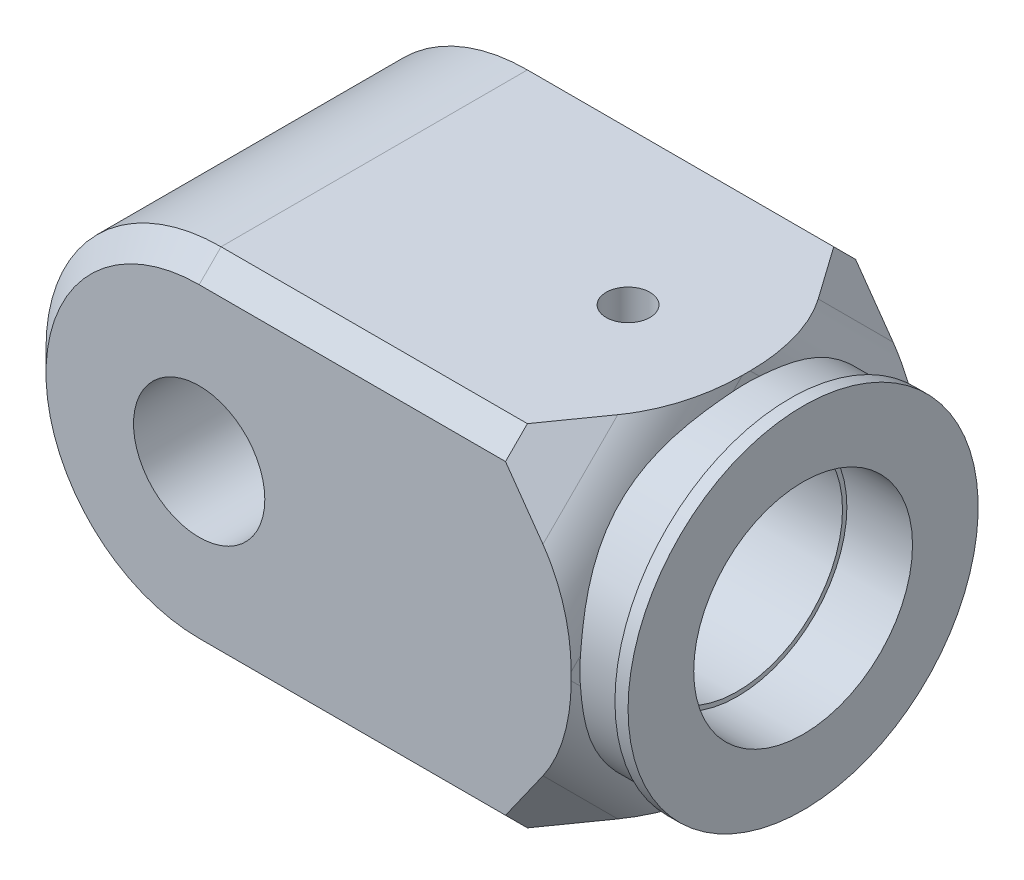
ISO-10303-21;
HEADER;
FILE_DESCRIPTION(('STEP AP214'),'2;1');
FILE_NAME('part.step','',(''),(''),'','','');
FILE_SCHEMA(('AUTOMOTIVE_DESIGN { 1 0 10303 214 1 1 1 1 }'));
ENDSEC;
DATA;
#1=APPLICATION_CONTEXT('core data for automotive mechanical design processes');
#2=APPLICATION_PROTOCOL_DEFINITION('international standard','automotive_design',2000,#1);
#3=PRODUCT_CONTEXT('',#1,'mechanical');
#4=PRODUCT('Part','Part','',(#3));
#5=PRODUCT_RELATED_PRODUCT_CATEGORY('part','',(#4));
#6=PRODUCT_DEFINITION_FORMATION('','',#4);
#7=PRODUCT_DEFINITION_CONTEXT('part definition',#1,'design');
#8=PRODUCT_DEFINITION('design','',#6,#7);
#9=PRODUCT_DEFINITION_SHAPE('','',#8);
#10=(LENGTH_UNIT() NAMED_UNIT(*) SI_UNIT(.MILLI.,.METRE.));
#11=(NAMED_UNIT(*) PLANE_ANGLE_UNIT() SI_UNIT($,.RADIAN.));
#12=(NAMED_UNIT(*) SI_UNIT($,.STERADIAN.) SOLID_ANGLE_UNIT());
#13=UNCERTAINTY_MEASURE_WITH_UNIT(LENGTH_MEASURE(1.E-05),#10,'distance_accuracy_value','');
#14=(GEOMETRIC_REPRESENTATION_CONTEXT(3) GLOBAL_UNCERTAINTY_ASSIGNED_CONTEXT((#13)) GLOBAL_UNIT_ASSIGNED_CONTEXT((#10,
#11,#12)) REPRESENTATION_CONTEXT('',''));
#15=CARTESIAN_POINT('',(0.,0.,0.));
#16=DIRECTION('',(0.,0.,1.));
#17=DIRECTION('',(1.,0.,0.));
#18=AXIS2_PLACEMENT_3D('',#15,#16,#17);
#19=CARTESIAN_POINT('',(85.,38.,0.));
#20=DIRECTION('',(-1.,0.,0.));
#21=DIRECTION('',(0.,0.,1.));
#22=AXIS2_PLACEMENT_3D('',#19,#20,#21);
#23=PLANE('',#22);
#24=DIRECTION('',(0.,1.,0.));
#25=VECTOR('',#24,1.);
#26=CARTESIAN_POINT('',(85.,40.,-40.));
#27=LINE('',#26,#25);
#28=CARTESIAN_POINT('',(85.,-0.899494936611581,-40.));
#29=VERTEX_POINT('',#28);
#30=CARTESIAN_POINT('',(85.,0.899494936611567,-40.));
#31=VERTEX_POINT('',#30);
#32=EDGE_CURVE('E310',#29,#31,#27,.T.);
#33=ORIENTED_EDGE('',*,*,#32,.T.);
#34=DIRECTION('',(0.,-0.70710678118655,-0.707106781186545));
#35=VECTOR('',#34,1.);
#36=CARTESIAN_POINT('',(85.,33.556349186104,-7.34314575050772));
#37=LINE('',#36,#35);
#38=CARTESIAN_POINT('',(85.,3.01966346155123,-37.8798314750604));
#39=VERTEX_POINT('',#38);
#40=EDGE_CURVE('E330',#31,#39,#37,.F.);
#41=ORIENTED_EDGE('',*,*,#40,.T.);
#42=CARTESIAN_POINT('',(85.,0.,0.));
#43=DIRECTION('',(-1.,0.,0.));
#44=DIRECTION('',(0.,0.,1.));
#45=AXIS2_PLACEMENT_3D('',#42,#43,#44);
#46=CIRCLE('',#45,38.);
#47=CARTESIAN_POINT('',(85.,-3.01966346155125,-37.8798314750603));
#48=VERTEX_POINT('',#47);
#49=EDGE_CURVE('E389',#39,#48,#46,.T.);
#50=ORIENTED_EDGE('',*,*,#49,.T.);
#51=DIRECTION('',(0.,-0.707106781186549,0.707106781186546));
#52=VECTOR('',#51,1.);
#53=CARTESIAN_POINT('',(85.,-7.34314575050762,-33.556349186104));
#54=LINE('',#53,#52);
#55=EDGE_CURVE('E317',#48,#29,#54,.F.);
#56=ORIENTED_EDGE('',*,*,#55,.T.);
#57=EDGE_LOOP('',(#33,#41,#50,#56));
#58=FACE_BOUND('',#57,.T.);
#59=ADVANCED_FACE('F35',(#58),#23,.F.);
#60=DIRECTION('',(0.,0.,-1.));
#61=VECTOR('',#60,1.);
#62=CARTESIAN_POINT('',(85.,-40.,40.));
#63=LINE('',#62,#61);
#64=CARTESIAN_POINT('',(85.,-40.,0.899494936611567));
#65=VERTEX_POINT('',#64);
#66=CARTESIAN_POINT('',(85.,-40.,-0.899494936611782));
#67=VERTEX_POINT('',#66);
#68=EDGE_CURVE('E202',#65,#67,#63,.T.);
#69=ORIENTED_EDGE('',*,*,#68,.T.);
#70=DIRECTION('',(0.,-0.707106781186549,0.707106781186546));
#71=VECTOR('',#70,1.);
#72=CARTESIAN_POINT('',(85.,-7.34314575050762,-33.556349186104));
#73=LINE('',#72,#71);
#74=CARTESIAN_POINT('',(85.,-37.8798314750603,-3.01966346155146));
#75=VERTEX_POINT('',#74);
#76=EDGE_CURVE('E320',#67,#75,#73,.F.);
#77=ORIENTED_EDGE('',*,*,#76,.T.);
#78=CARTESIAN_POINT('',(85.,-37.8798314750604,3.01966346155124));
#79=VERTEX_POINT('',#78);
#80=EDGE_CURVE('E390',#75,#79,#46,.T.);
#81=ORIENTED_EDGE('',*,*,#80,.T.);
#82=DIRECTION('',(0.,-0.707106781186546,-0.707106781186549));
#83=VECTOR('',#82,1.);
#84=CARTESIAN_POINT('',(85.,-33.556349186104,7.3431457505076));
#85=LINE('',#84,#83);
#86=EDGE_CURVE('E318',#79,#65,#85,.T.);
#87=ORIENTED_EDGE('',*,*,#86,.T.);
#88=EDGE_LOOP('',(#69,#77,#81,#87));
#89=FACE_BOUND('',#88,.T.);
#90=ADVANCED_FACE('F268',(#89),#23,.F.);
#91=DIRECTION('',(0.,1.,0.));
#92=VECTOR('',#91,1.);
#93=CARTESIAN_POINT('',(85.,40.,40.));
#94=LINE('',#93,#92);
#95=CARTESIAN_POINT('',(85.,-0.899494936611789,40.));
#96=VERTEX_POINT('',#95);
#97=CARTESIAN_POINT('',(85.,0.899494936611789,40.));
#98=VERTEX_POINT('',#97);
#99=EDGE_CURVE('E302',#96,#98,#94,.T.);
#100=ORIENTED_EDGE('',*,*,#99,.F.);
#101=DIRECTION('',(0.,-0.707106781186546,-0.707106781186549));
#102=VECTOR('',#101,1.);
#103=CARTESIAN_POINT('',(85.,-33.556349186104,7.3431457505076));
#104=LINE('',#103,#102);
#105=CARTESIAN_POINT('',(85.,-3.01966346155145,37.8798314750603));
#106=VERTEX_POINT('',#105);
#107=EDGE_CURVE('E305',#96,#106,#104,.T.);
#108=ORIENTED_EDGE('',*,*,#107,.T.);
#109=CARTESIAN_POINT('',(85.,3.01966346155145,37.8798314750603));
#110=VERTEX_POINT('',#109);
#111=EDGE_CURVE('E201',#106,#110,#46,.T.);
#112=ORIENTED_EDGE('',*,*,#111,.T.);
#113=DIRECTION('',(0.,-0.707106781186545,0.70710678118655));
#114=VECTOR('',#113,1.);
#115=CARTESIAN_POINT('',(85.,7.34314575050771,33.5563491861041));
#116=LINE('',#115,#114);
#117=EDGE_CURVE('E308',#110,#98,#116,.T.);
#118=ORIENTED_EDGE('',*,*,#117,.T.);
#119=EDGE_LOOP('',(#100,#108,#112,#118));
#120=FACE_BOUND('',#119,.T.);
#121=ADVANCED_FACE('F275',(#120),#23,.F.);
#122=CARTESIAN_POINT('',(0.,0.,40.));
#123=DIRECTION('',(0.,0.,-1.));
#124=DIRECTION('',(-1.,0.,0.));
#125=AXIS2_PLACEMENT_3D('',#122,#123,#124);
#126=CYLINDRICAL_SURFACE('',#125,40.);
#127=DIRECTION('',(0.,0.,-1.));
#128=VECTOR('',#127,1.);
#129=CARTESIAN_POINT('',(0.,40.,40.));
#130=LINE('',#129,#128);
#131=CARTESIAN_POINT('',(0.,40.,35.));
#132=VERTEX_POINT('',#131);
#133=CARTESIAN_POINT('',(0.,40.,-35.));
#134=VERTEX_POINT('',#133);
#135=EDGE_CURVE('E309',#132,#134,#130,.T.);
#136=ORIENTED_EDGE('',*,*,#135,.T.);
#137=CARTESIAN_POINT('',(0.,0.,-35.));
#138=DIRECTION('',(0.,0.,1.));
#139=DIRECTION('',(1.,0.,0.));
#140=AXIS2_PLACEMENT_3D('',#137,#138,#139);
#141=CIRCLE('',#140,40.);
#142=CARTESIAN_POINT('',(0.,-40.,-35.));
#143=VERTEX_POINT('',#142);
#144=EDGE_CURVE('E200',#134,#143,#141,.T.);
#145=ORIENTED_EDGE('',*,*,#144,.T.);
#146=DIRECTION('',(0.,0.,-1.));
#147=VECTOR('',#146,1.);
#148=CARTESIAN_POINT('',(0.,-40.,40.));
#149=LINE('',#148,#147);
#150=CARTESIAN_POINT('',(0.,-40.,35.));
#151=VERTEX_POINT('',#150);
#152=EDGE_CURVE('E184',#151,#143,#149,.T.);
#153=ORIENTED_EDGE('',*,*,#152,.F.);
#154=CARTESIAN_POINT('',(0.,0.,35.));
#155=DIRECTION('',(0.,0.,1.));
#156=DIRECTION('',(1.,0.,0.));
#157=AXIS2_PLACEMENT_3D('',#154,#155,#156);
#158=CIRCLE('',#157,40.);
#159=EDGE_CURVE('E197',#151,#132,#158,.F.);
#160=ORIENTED_EDGE('',*,*,#159,.T.);
#161=EDGE_LOOP('',(#136,#145,#153,#160));
#162=FACE_BOUND('',#161,.T.);
#163=ADVANCED_FACE('F196',(#162),#126,.T.);
#164=CARTESIAN_POINT('',(0.,0.,40.));
#165=DIRECTION('',(0.,0.,1.));
#166=DIRECTION('',(1.,0.,0.));
#167=AXIS2_PLACEMENT_3D('',#164,#165,#166);
#168=PLANE('',#167);
#169=CARTESIAN_POINT('',(0.,0.,40.));
#170=DIRECTION('',(0.,0.,1.));
#171=DIRECTION('',(1.,0.,0.));
#172=AXIS2_PLACEMENT_3D('',#169,#170,#171);
#173=CIRCLE('',#172,15.);
#174=CARTESIAN_POINT('',(15.,0.,40.));
#175=VERTEX_POINT('',#174);
#176=EDGE_CURVE('E462',#175,#175,#173,.T.);
#177=ORIENTED_EDGE('',*,*,#176,.F.);
#178=EDGE_LOOP('',(#177));
#179=FACE_BOUND('',#178,.T.);
#180=DIRECTION('',(0.577350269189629,0.816496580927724,0.));
#181=VECTOR('',#180,1.);
#182=CARTESIAN_POINT('',(63.1658248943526,-44.6649831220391,40.));
#183=LINE('',#182,#181);
#184=CARTESIAN_POINT('',(70.,-35.,40.));
#185=VERTEX_POINT('',#184);
#186=CARTESIAN_POINT('',(78.556349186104,-22.8994949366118,40.));
#187=VERTEX_POINT('',#186);
#188=EDGE_CURVE('E415',#185,#187,#183,.T.);
#189=ORIENTED_EDGE('',*,*,#188,.T.);
#190=CARTESIAN_POINT('',(63.,-0.899494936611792,40.));
#191=DIRECTION('',(0.,0.,1.));
#192=DIRECTION('',(0.,1.,0.));
#193=AXIS2_PLACEMENT_3D('',#190,#191,#192);
#194=ELLIPSE('',#193,31.112698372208,22.);
#195=EDGE_CURVE('E315',#187,#96,#194,.T.);
#196=ORIENTED_EDGE('',*,*,#195,.T.);
#197=ORIENTED_EDGE('',*,*,#99,.T.);
#198=CARTESIAN_POINT('',(63.,0.899494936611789,40.));
#199=DIRECTION('',(0.,0.,1.));
#200=DIRECTION('',(0.,1.,0.));
#201=AXIS2_PLACEMENT_3D('',#198,#199,#200);
#202=ELLIPSE('',#201,31.112698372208,22.);
#203=CARTESIAN_POINT('',(78.556349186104,22.8994949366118,40.));
#204=VERTEX_POINT('',#203);
#205=EDGE_CURVE('E55',#98,#204,#202,.T.);
#206=ORIENTED_EDGE('',*,*,#205,.T.);
#207=DIRECTION('',(-0.577350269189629,0.816496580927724,0.));
#208=VECTOR('',#207,1.);
#209=CARTESIAN_POINT('',(63.1658248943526,44.6649831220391,40.));
#210=LINE('',#209,#208);
#211=CARTESIAN_POINT('',(70.,35.,40.));
#212=VERTEX_POINT('',#211);
#213=EDGE_CURVE('E445',#204,#212,#210,.T.);
#214=ORIENTED_EDGE('',*,*,#213,.T.);
#215=DIRECTION('',(-1.,0.,0.));
#216=VECTOR('',#215,1.);
#217=CARTESIAN_POINT('',(0.,35.,40.));
#218=LINE('',#217,#216);
#219=CARTESIAN_POINT('',(0.,35.,40.));
#220=VERTEX_POINT('',#219);
#221=EDGE_CURVE('E450',#212,#220,#218,.T.);
#222=ORIENTED_EDGE('',*,*,#221,.T.);
#223=CARTESIAN_POINT('',(0.,0.,40.));
#224=DIRECTION('',(0.,0.,1.));
#225=DIRECTION('',(1.,0.,0.));
#226=AXIS2_PLACEMENT_3D('',#223,#224,#225);
#227=CIRCLE('',#226,35.);
#228=CARTESIAN_POINT('',(0.,-35.,40.));
#229=VERTEX_POINT('',#228);
#230=EDGE_CURVE('E448',#220,#229,#227,.T.);
#231=ORIENTED_EDGE('',*,*,#230,.T.);
#232=DIRECTION('',(1.,0.,0.));
#233=VECTOR('',#232,1.);
#234=CARTESIAN_POINT('',(85.,-35.,40.));
#235=LINE('',#234,#233);
#236=EDGE_CURVE('E217',#229,#185,#235,.T.);
#237=ORIENTED_EDGE('',*,*,#236,.T.);
#238=EDGE_LOOP('',(#189,#196,#197,#206,#214,#222,#231,#237));
#239=FACE_BOUND('',#238,.T.);
#240=ADVANCED_FACE('F298',(#179,#239),#168,.T.);
#241=CARTESIAN_POINT('',(0.,0.,-40.));
#242=DIRECTION('',(0.,0.,1.));
#243=DIRECTION('',(1.,0.,0.));
#244=AXIS2_PLACEMENT_3D('',#241,#242,#243);
#245=PLANE('',#244);
#246=CARTESIAN_POINT('',(0.,0.,-40.));
#247=DIRECTION('',(0.,0.,1.));
#248=DIRECTION('',(1.,0.,0.));
#249=AXIS2_PLACEMENT_3D('',#246,#247,#248);
#250=CIRCLE('',#249,15.);
#251=CARTESIAN_POINT('',(15.,0.,-40.));
#252=VERTEX_POINT('',#251);
#253=EDGE_CURVE('E457',#252,#252,#250,.T.);
#254=ORIENTED_EDGE('',*,*,#253,.T.);
#255=EDGE_LOOP('',(#254));
#256=FACE_BOUND('',#255,.T.);
#257=DIRECTION('',(-0.577350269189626,0.816496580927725,0.));
#258=VECTOR('',#257,1.);
#259=CARTESIAN_POINT('',(69.8648028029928,35.1911977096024,-40.));
#260=LINE('',#259,#258);
#261=CARTESIAN_POINT('',(70.,35.,-40.));
#262=VERTEX_POINT('',#261);
#263=CARTESIAN_POINT('',(78.556349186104,22.8994949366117,-40.));
#264=VERTEX_POINT('',#263);
#265=EDGE_CURVE('E411',#262,#264,#260,.F.);
#266=ORIENTED_EDGE('',*,*,#265,.T.);
#267=CARTESIAN_POINT('',(63.,0.899494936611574,-40.));
#268=DIRECTION('',(0.,0.,1.));
#269=DIRECTION('',(0.,1.,0.));
#270=AXIS2_PLACEMENT_3D('',#267,#268,#269);
#271=ELLIPSE('',#270,31.1126983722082,22.);
#272=EDGE_CURVE('E341',#264,#31,#271,.F.);
#273=ORIENTED_EDGE('',*,*,#272,.T.);
#274=ORIENTED_EDGE('',*,*,#32,.F.);
#275=CARTESIAN_POINT('',(63.,-0.899494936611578,-40.));
#276=DIRECTION('',(0.,0.,1.));
#277=DIRECTION('',(0.,1.,0.));
#278=AXIS2_PLACEMENT_3D('',#275,#276,#277);
#279=ELLIPSE('',#278,31.1126983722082,22.);
#280=CARTESIAN_POINT('',(78.556349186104,-22.8994949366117,-40.));
#281=VERTEX_POINT('',#280);
#282=EDGE_CURVE('E339',#29,#281,#279,.F.);
#283=ORIENTED_EDGE('',*,*,#282,.T.);
#284=DIRECTION('',(0.577350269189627,0.816496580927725,0.));
#285=VECTOR('',#284,1.);
#286=CARTESIAN_POINT('',(87.7781745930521,-9.85786437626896,-40.));
#287=LINE('',#286,#285);
#288=CARTESIAN_POINT('',(70.,-35.,-40.));
#289=VERTEX_POINT('',#288);
#290=EDGE_CURVE('E404',#281,#289,#287,.F.);
#291=ORIENTED_EDGE('',*,*,#290,.T.);
#292=DIRECTION('',(-1.,0.,0.));
#293=VECTOR('',#292,1.);
#294=CARTESIAN_POINT('',(0.,-35.,-40.));
#295=LINE('',#294,#293);
#296=CARTESIAN_POINT('',(0.,-35.,-40.));
#297=VERTEX_POINT('',#296);
#298=EDGE_CURVE('E213',#289,#297,#295,.T.);
#299=ORIENTED_EDGE('',*,*,#298,.T.);
#300=CARTESIAN_POINT('',(0.,0.,-40.));
#301=DIRECTION('',(0.,0.,1.));
#302=DIRECTION('',(1.,0.,0.));
#303=AXIS2_PLACEMENT_3D('',#300,#301,#302);
#304=CIRCLE('',#303,35.);
#305=CARTESIAN_POINT('',(0.,35.,-40.));
#306=VERTEX_POINT('',#305);
#307=EDGE_CURVE('E475',#297,#306,#304,.F.);
#308=ORIENTED_EDGE('',*,*,#307,.T.);
#309=DIRECTION('',(1.,0.,0.));
#310=VECTOR('',#309,1.);
#311=CARTESIAN_POINT('',(0.,35.,-40.));
#312=LINE('',#311,#310);
#313=EDGE_CURVE('E472',#306,#262,#312,.T.);
#314=ORIENTED_EDGE('',*,*,#313,.T.);
#315=EDGE_LOOP('',(#266,#273,#274,#283,#291,#299,#308,#314));
#316=FACE_BOUND('',#315,.T.);
#317=ADVANCED_FACE('F403',(#256,#316),#245,.F.);
#318=CARTESIAN_POINT('',(62.5000000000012,-40.,40.));
#319=DIRECTION('',(0.,1.,0.));
#320=DIRECTION('',(0.,0.,1.));
#321=AXIS2_PLACEMENT_3D('',#318,#319,#320);
#322=PLANE('',#321);
#323=CARTESIAN_POINT('',(58.0000000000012,-40.,0.));
#324=DIRECTION('',(0.,1.,0.));
#325=DIRECTION('',(0.,0.,1.));
#326=AXIS2_PLACEMENT_3D('',#323,#324,#325);
#327=CIRCLE('',#326,5.);
#328=CARTESIAN_POINT('',(58.0000000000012,-40.,5.));
#329=VERTEX_POINT('',#328);
#330=EDGE_CURVE('E809',#329,#329,#327,.T.);
#331=ORIENTED_EDGE('',*,*,#330,.T.);
#332=EDGE_LOOP('',(#331));
#333=FACE_BOUND('',#332,.T.);
#334=DIRECTION('',(-0.577350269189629,0.,-0.816496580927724));
#335=VECTOR('',#334,1.);
#336=CARTESIAN_POINT('',(69.8648028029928,-40.,-35.1911977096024));
#337=LINE('',#336,#335);
#338=CARTESIAN_POINT('',(70.,-40.,-35.));
#339=VERTEX_POINT('',#338);
#340=CARTESIAN_POINT('',(78.556349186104,-40.,-22.8994949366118));
#341=VERTEX_POINT('',#340);
#342=EDGE_CURVE('E443',#339,#341,#337,.F.);
#343=ORIENTED_EDGE('',*,*,#342,.T.);
#344=CARTESIAN_POINT('',(63.,-40.,-0.899494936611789));
#345=DIRECTION('',(0.,1.,0.));
#346=DIRECTION('',(0.,0.,-1.));
#347=AXIS2_PLACEMENT_3D('',#344,#345,#346);
#348=ELLIPSE('',#347,31.112698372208,22.);
#349=EDGE_CURVE('E347',#341,#67,#348,.F.);
#350=ORIENTED_EDGE('',*,*,#349,.T.);
#351=ORIENTED_EDGE('',*,*,#68,.F.);
#352=CARTESIAN_POINT('',(63.,-40.,0.899494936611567));
#353=DIRECTION('',(0.,1.,0.));
#354=DIRECTION('',(0.,0.,1.));
#355=AXIS2_PLACEMENT_3D('',#352,#353,#354);
#356=ELLIPSE('',#355,31.1126983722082,22.);
#357=CARTESIAN_POINT('',(78.556349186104,-40.,22.8994949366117));
#358=VERTEX_POINT('',#357);
#359=EDGE_CURVE('E345',#65,#358,#356,.F.);
#360=ORIENTED_EDGE('',*,*,#359,.T.);
#361=DIRECTION('',(-0.577350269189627,0.,0.816496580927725));
#362=VECTOR('',#361,1.);
#363=CARTESIAN_POINT('',(69.8648028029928,-40.,35.1911977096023));
#364=LINE('',#363,#362);
#365=CARTESIAN_POINT('',(70.,-40.,35.));
#366=VERTEX_POINT('',#365);
#367=EDGE_CURVE('E186',#358,#366,#364,.T.);
#368=ORIENTED_EDGE('',*,*,#367,.T.);
#369=DIRECTION('',(-1.,0.,0.));
#370=VECTOR('',#369,1.);
#371=CARTESIAN_POINT('',(0.,-40.,35.));
#372=LINE('',#371,#370);
#373=EDGE_CURVE('E179',#366,#151,#372,.T.);
#374=ORIENTED_EDGE('',*,*,#373,.T.);
#375=ORIENTED_EDGE('',*,*,#152,.T.);
#376=DIRECTION('',(1.,0.,0.));
#377=VECTOR('',#376,1.);
#378=CARTESIAN_POINT('',(62.5000000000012,-40.,-35.));
#379=LINE('',#378,#377);
#380=EDGE_CURVE('E190',#143,#339,#379,.T.);
#381=ORIENTED_EDGE('',*,*,#380,.T.);
#382=EDGE_LOOP('',(#343,#350,#351,#360,#368,#374,#375,#381));
#383=FACE_BOUND('',#382,.T.);
#384=ADVANCED_FACE('F182',(#333,#383),#322,.F.);
#385=CARTESIAN_POINT('',(62.5000000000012,40.,40.));
#386=DIRECTION('',(0.,-1.,0.));
#387=DIRECTION('',(0.,0.,-1.));
#388=AXIS2_PLACEMENT_3D('',#385,#386,#387);
#389=PLANE('',#388);
#390=CARTESIAN_POINT('',(58.0000000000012,40.,0.));
#391=DIRECTION('',(0.,1.,0.));
#392=DIRECTION('',(0.,0.,1.));
#393=AXIS2_PLACEMENT_3D('',#390,#391,#392);
#394=CIRCLE('',#393,5.);
#395=CARTESIAN_POINT('',(58.0000000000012,40.,5.));
#396=VERTEX_POINT('',#395);
#397=EDGE_CURVE('E237',#396,#396,#394,.T.);
#398=ORIENTED_EDGE('',*,*,#397,.F.);
#399=EDGE_LOOP('',(#398));
#400=FACE_BOUND('',#399,.T.);
#401=DIRECTION('',(0.,0.,-1.));
#402=VECTOR('',#401,1.);
#403=CARTESIAN_POINT('',(85.,40.,40.));
#404=LINE('',#403,#402);
#405=CARTESIAN_POINT('',(85.,40.,0.89949493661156));
#406=VERTEX_POINT('',#405);
#407=CARTESIAN_POINT('',(85.,40.,-0.899494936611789));
#408=VERTEX_POINT('',#407);
#409=EDGE_CURVE('E432',#406,#408,#404,.T.);
#410=ORIENTED_EDGE('',*,*,#409,.T.);
#411=CARTESIAN_POINT('',(63.,40.,-0.899494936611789));
#412=DIRECTION('',(0.,-1.,0.));
#413=DIRECTION('',(0.,0.,1.));
#414=AXIS2_PLACEMENT_3D('',#411,#412,#413);
#415=ELLIPSE('',#414,31.112698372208,22.);
#416=CARTESIAN_POINT('',(78.556349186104,40.,-22.8994949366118));
#417=VERTEX_POINT('',#416);
#418=EDGE_CURVE('E335',#408,#417,#415,.F.);
#419=ORIENTED_EDGE('',*,*,#418,.T.);
#420=DIRECTION('',(0.577350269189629,0.,0.816496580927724));
#421=VECTOR('',#420,1.);
#422=CARTESIAN_POINT('',(87.7781745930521,40.,-9.85786437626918));
#423=LINE('',#422,#421);
#424=CARTESIAN_POINT('',(70.,40.,-35.));
#425=VERTEX_POINT('',#424);
#426=EDGE_CURVE('E421',#417,#425,#423,.F.);
#427=ORIENTED_EDGE('',*,*,#426,.T.);
#428=DIRECTION('',(-1.,0.,0.));
#429=VECTOR('',#428,1.);
#430=CARTESIAN_POINT('',(62.5000000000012,40.,-35.));
#431=LINE('',#430,#429);
#432=EDGE_CURVE('E485',#425,#134,#431,.T.);
#433=ORIENTED_EDGE('',*,*,#432,.T.);
#434=ORIENTED_EDGE('',*,*,#135,.F.);
#435=DIRECTION('',(1.,0.,0.));
#436=VECTOR('',#435,1.);
#437=CARTESIAN_POINT('',(85.,40.,35.));
#438=LINE('',#437,#436);
#439=CARTESIAN_POINT('',(70.,40.,35.));
#440=VERTEX_POINT('',#439);
#441=EDGE_CURVE('E482',#132,#440,#438,.T.);
#442=ORIENTED_EDGE('',*,*,#441,.T.);
#443=DIRECTION('',(0.577350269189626,0.,-0.816496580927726));
#444=VECTOR('',#443,1.);
#445=CARTESIAN_POINT('',(87.7781745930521,40.,9.85786437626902));
#446=LINE('',#445,#444);
#447=CARTESIAN_POINT('',(78.556349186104,40.,22.8994949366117));
#448=VERTEX_POINT('',#447);
#449=EDGE_CURVE('E413',#440,#448,#446,.T.);
#450=ORIENTED_EDGE('',*,*,#449,.T.);
#451=CARTESIAN_POINT('',(63.,40.,0.899494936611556));
#452=DIRECTION('',(0.,-1.,0.));
#453=DIRECTION('',(0.,0.,-1.));
#454=AXIS2_PLACEMENT_3D('',#451,#452,#453);
#455=ELLIPSE('',#454,31.1126983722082,22.);
#456=EDGE_CURVE('E333',#448,#406,#455,.F.);
#457=ORIENTED_EDGE('',*,*,#456,.T.);
#458=EDGE_LOOP('',(#410,#419,#427,#433,#434,#442,#450,#457));
#459=FACE_BOUND('',#458,.T.);
#460=ADVANCED_FACE('F493',(#400,#459),#389,.F.);
#461=CARTESIAN_POINT('',(0.,0.,-52.));
#462=DIRECTION('',(0.,0.,1.));
#463=DIRECTION('',(1.,0.,0.));
#464=AXIS2_PLACEMENT_3D('',#461,#462,#463);
#465=CYLINDRICAL_SURFACE('',#464,15.);
#466=ORIENTED_EDGE('',*,*,#176,.T.);
#467=EDGE_LOOP('',(#466));
#468=FACE_BOUND('',#467,.T.);
#469=ORIENTED_EDGE('',*,*,#253,.F.);
#470=EDGE_LOOP('',(#469));
#471=FACE_BOUND('',#470,.T.);
#472=ADVANCED_FACE('F615',(#468,#471),#465,.F.);
#473=CARTESIAN_POINT('',(-67.3273470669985,0.,0.));
#474=DIRECTION('',(-1.,0.,0.));
#475=DIRECTION('',(0.,0.,1.));
#476=AXIS2_PLACEMENT_3D('',#473,#474,#475);
#477=CYLINDRICAL_SURFACE('',#476,25.);
#478=CARTESIAN_POINT('',(98.,0.,0.));
#479=DIRECTION('',(-1.,0.,0.));
#480=DIRECTION('',(0.,0.,1.));
#481=AXIS2_PLACEMENT_3D('',#478,#479,#480);
#482=CIRCLE('',#481,25.);
#483=CARTESIAN_POINT('',(98.,0.,25.));
#484=VERTEX_POINT('',#483);
#485=EDGE_CURVE('E191',#484,#484,#482,.T.);
#486=ORIENTED_EDGE('',*,*,#485,.F.);
#487=EDGE_LOOP('',(#486));
#488=FACE_BOUND('',#487,.T.);
#489=CARTESIAN_POINT('',(83.,0.,0.));
#490=DIRECTION('',(1.,0.,0.));
#491=DIRECTION('',(0.,0.,-1.));
#492=AXIS2_PLACEMENT_3D('',#489,#490,#491);
#493=CIRCLE('',#492,25.);
#494=CARTESIAN_POINT('',(83.,0.,-25.));
#495=VERTEX_POINT('',#494);
#496=EDGE_CURVE('E218',#495,#495,#493,.T.);
#497=ORIENTED_EDGE('',*,*,#496,.F.);
#498=EDGE_LOOP('',(#497));
#499=FACE_BOUND('',#498,.T.);
#500=ADVANCED_FACE('F699',(#488,#499),#477,.F.);
#501=CARTESIAN_POINT('',(98.0000000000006,25.,0.));
#502=DIRECTION('',(-1.,0.,0.));
#503=DIRECTION('',(0.,0.,1.));
#504=AXIS2_PLACEMENT_3D('',#501,#502,#503);
#505=PLANE('',#504);
#506=CARTESIAN_POINT('',(98.0000000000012,0.,0.));
#507=DIRECTION('',(-1.,0.,0.));
#508=DIRECTION('',(0.,0.,1.));
#509=AXIS2_PLACEMENT_3D('',#506,#507,#508);
#510=CIRCLE('',#509,40.);
#511=CARTESIAN_POINT('',(98.0000000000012,0.,40.));
#512=VERTEX_POINT('',#511);
#513=EDGE_CURVE('E760',#512,#512,#510,.T.);
#514=ORIENTED_EDGE('',*,*,#513,.F.);
#515=EDGE_LOOP('',(#514));
#516=FACE_BOUND('',#515,.T.);
#517=ORIENTED_EDGE('',*,*,#485,.T.);
#518=EDGE_LOOP('',(#517));
#519=FACE_BOUND('',#518,.T.);
#520=ADVANCED_FACE('F703',(#516,#519),#505,.F.);
#521=CARTESIAN_POINT('',(-67.3273470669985,0.,0.));
#522=DIRECTION('',(-1.,0.,0.));
#523=DIRECTION('',(0.,0.,1.));
#524=AXIS2_PLACEMENT_3D('',#521,#522,#523);
#525=CYLINDRICAL_SURFACE('',#524,40.);
#526=CARTESIAN_POINT('',(95.,0.,0.));
#527=DIRECTION('',(-1.,0.,0.));
#528=DIRECTION('',(0.,0.,1.));
#529=AXIS2_PLACEMENT_3D('',#526,#527,#528);
#530=CIRCLE('',#529,40.);
#531=CARTESIAN_POINT('',(95.,0.,40.));
#532=VERTEX_POINT('',#531);
#533=EDGE_CURVE('E437',#532,#532,#530,.T.);
#534=ORIENTED_EDGE('',*,*,#533,.F.);
#535=EDGE_LOOP('',(#534));
#536=FACE_BOUND('',#535,.T.);
#537=ORIENTED_EDGE('',*,*,#513,.T.);
#538=EDGE_LOOP('',(#537));
#539=FACE_BOUND('',#538,.T.);
#540=ADVANCED_FACE('F736',(#536,#539),#525,.T.);
#541=CARTESIAN_POINT('',(95.,38.,0.));
#542=DIRECTION('',(1.,0.,0.));
#543=DIRECTION('',(0.,0.,-1.));
#544=AXIS2_PLACEMENT_3D('',#541,#542,#543);
#545=PLANE('',#544);
#546=CARTESIAN_POINT('',(95.,0.,0.));
#547=DIRECTION('',(-1.,0.,0.));
#548=DIRECTION('',(0.,0.,1.));
#549=AXIS2_PLACEMENT_3D('',#546,#547,#548);
#550=CIRCLE('',#549,38.);
#551=CARTESIAN_POINT('',(95.,0.,38.));
#552=VERTEX_POINT('',#551);
#553=EDGE_CURVE('E435',#552,#552,#550,.T.);
#554=ORIENTED_EDGE('',*,*,#553,.F.);
#555=EDGE_LOOP('',(#554));
#556=FACE_BOUND('',#555,.T.);
#557=ORIENTED_EDGE('',*,*,#533,.T.);
#558=EDGE_LOOP('',(#557));
#559=FACE_BOUND('',#558,.T.);
#560=ADVANCED_FACE('F290',(#556,#559),#545,.F.);
#561=CARTESIAN_POINT('',(-67.3273470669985,0.,0.));
#562=DIRECTION('',(-1.,0.,0.));
#563=DIRECTION('',(0.,0.,1.));
#564=AXIS2_PLACEMENT_3D('',#561,#562,#563);
#565=CYLINDRICAL_SURFACE('',#564,38.);
#566=CARTESIAN_POINT('',(85.,37.8798314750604,3.01966346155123));
#567=VERTEX_POINT('',#566);
#568=CARTESIAN_POINT('',(85.,37.8798314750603,-3.01966346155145));
#569=VERTEX_POINT('',#568);
#570=EDGE_CURVE('E395',#567,#569,#46,.T.);
#571=ORIENTED_EDGE('',*,*,#570,.F.);
#572=CARTESIAN_POINT('',(85.,37.8798314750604,3.01966346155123));
#573=CARTESIAN_POINT('',(84.9999926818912,37.842748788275,3.48489431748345));
#574=CARTESIAN_POINT('',(84.9937516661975,37.7970933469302,3.94935199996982));
#575=CARTESIAN_POINT('',(84.9703766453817,37.6887633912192,4.87592037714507));
#576=CARTESIAN_POINT('',(84.9532446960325,37.6260920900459,5.33803149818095));
#577=CARTESIAN_POINT('',(84.8879203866,37.412885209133,6.71882538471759));
#578=CARTESIAN_POINT('',(84.8257921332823,37.2370689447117,7.63306484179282));
#579=CARTESIAN_POINT('',(84.6762424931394,36.8193196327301,9.44473689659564));
#580=CARTESIAN_POINT('',(84.5888007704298,36.5773334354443,10.3421553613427));
#581=CARTESIAN_POINT('',(84.3997994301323,36.0287361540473,12.1157755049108));
#582=CARTESIAN_POINT('',(84.2982353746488,35.7221047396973,12.9919704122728));
#583=CARTESIAN_POINT('',(84.0844147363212,35.022649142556,14.7782264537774));
#584=CARTESIAN_POINT('',(83.971901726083,34.6253671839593,15.6865109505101));
#585=CARTESIAN_POINT('',(83.7545376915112,33.7605990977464,17.4700813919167));
#586=CARTESIAN_POINT('',(83.6496862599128,33.2931167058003,18.3453690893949));
#587=CARTESIAN_POINT('',(83.5060630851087,32.5412702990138,19.6293555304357));
#588=CARTESIAN_POINT('',(83.4604801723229,32.2823336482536,20.0523601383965));
#589=CARTESIAN_POINT('',(83.374957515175,31.7478340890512,20.8882995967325));
#590=CARTESIAN_POINT('',(83.335017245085,31.4722727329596,21.3012353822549));
#591=CARTESIAN_POINT('',(83.26178894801,30.9048582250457,22.1164284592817));
#592=CARTESIAN_POINT('',(83.2285016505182,30.6130032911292,22.5186845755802));
#593=CARTESIAN_POINT('',(83.1694329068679,30.0134844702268,23.3117527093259));
#594=CARTESIAN_POINT('',(83.1436507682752,29.7058220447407,23.7025657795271));
#595=CARTESIAN_POINT('',(83.0990284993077,29.057349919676,24.4938076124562));
#596=CARTESIAN_POINT('',(83.0806623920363,28.715649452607,24.8935338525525));
#597=CARTESIAN_POINT('',(83.0535786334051,28.0157774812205,25.6786442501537));
#598=CARTESIAN_POINT('',(83.0448610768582,27.6576058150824,26.0640282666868));
#599=CARTESIAN_POINT('',(83.0373282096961,26.9255031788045,26.8196574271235));
#600=CARTESIAN_POINT('',(83.0385132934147,26.5515715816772,27.1899019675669));
#601=CARTESIAN_POINT('',(83.0507520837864,25.7887443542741,27.9144656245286));
#602=CARTESIAN_POINT('',(83.0618057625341,25.3998487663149,28.2687847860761));
#603=CARTESIAN_POINT('',(83.0934795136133,24.6074230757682,28.9612140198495));
#604=CARTESIAN_POINT('',(83.1141112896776,24.2038756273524,29.2993037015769));
#605=CARTESIAN_POINT('',(83.164346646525,23.3834318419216,29.9581698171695));
#606=CARTESIAN_POINT('',(83.1939502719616,22.9665354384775,30.2789461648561));
#607=CARTESIAN_POINT('',(83.2612813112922,22.1202278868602,30.902617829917));
#608=CARTESIAN_POINT('',(83.299008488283,21.6908171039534,31.2055136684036));
#609=CARTESIAN_POINT('',(83.3815043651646,20.8203124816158,31.7929296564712));
#610=CARTESIAN_POINT('',(83.4262729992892,20.3792187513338,32.0774499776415));
#611=CARTESIAN_POINT('',(83.5635459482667,19.0933694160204,32.869660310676));
#612=CARTESIAN_POINT('',(83.6634165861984,18.2346412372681,33.3536552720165));
#613=CARTESIAN_POINT('',(83.8738986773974,16.4833461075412,34.2530112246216));
#614=CARTESIAN_POINT('',(83.9845108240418,15.590776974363,34.6683677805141));
#615=CARTESIAN_POINT('',(84.2050752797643,13.7775680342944,35.4279967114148));
#616=CARTESIAN_POINT('',(84.3150283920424,12.8569786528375,35.7723890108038));
#617=CARTESIAN_POINT('',(84.5222500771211,10.9909350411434,36.3890758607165));
#618=CARTESIAN_POINT('',(84.6195230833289,10.0454896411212,36.6613956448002));
#619=CARTESIAN_POINT('',(84.791726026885,8.09573075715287,37.1417045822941));
#620=CARTESIAN_POINT('',(84.8656110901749,7.09057278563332,37.3466976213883));
#621=CARTESIAN_POINT('',(84.9437014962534,5.57143412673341,37.5928524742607));
#622=CARTESIAN_POINT('',(84.9642758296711,5.06310579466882,37.6646855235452));
#623=CARTESIAN_POINT('',(84.9924224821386,4.04339157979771,37.7877611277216));
#624=CARTESIAN_POINT('',(84.9999892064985,3.53200447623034,37.8389948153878));
#625=CARTESIAN_POINT('',(85.,3.01966346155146,37.8798314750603));
#626=B_SPLINE_CURVE_WITH_KNOTS('',3,(#572,#573,#574,#575,#576,#577,#578,#579,#580,#581,#582,
#583,#584,#585,#586,#587,#588,#589,#590,#591,#592,#593,#594,#595,#596,#597,#598,#599,#600,#601,
#602,#603,#604,#605,#606,#607,#608,#609,#610,#611,#612,#613,#614,#615,#616,#617,#618,#619,#620,
#621,#622,#623,#624,#625),.UNSPECIFIED.,.F.,.F.,(4,2,2,2,2,2,2,2,2,2,2,2,2,2,2,2,2,2,2,2,2,2,2,
2,2,2,4),(0.,1.39984299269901,2.79942182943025,5.59529127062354,8.39341307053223,
11.1924161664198,14.1826677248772,17.1727602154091,18.6665880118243,20.1602765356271,
21.6541287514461,23.1478430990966,24.7258760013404,26.303924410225,27.8820356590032,
29.4601424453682,31.0401826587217,32.6202307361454,34.2002327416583,35.7802199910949,
38.7491822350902,41.7183362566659,44.6824307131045,47.6454860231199,50.7266221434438,
52.2674809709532,53.8090023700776),.UNSPECIFIED.);
#627=EDGE_CURVE('E11',#567,#110,#626,.T.);
#628=ORIENTED_EDGE('',*,*,#627,.T.);
#629=ORIENTED_EDGE('',*,*,#111,.F.);
#630=CARTESIAN_POINT('',(85.,-3.01966346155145,37.8798314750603));
#631=CARTESIAN_POINT('',(84.9999926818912,-3.48489431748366,37.842748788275));
#632=CARTESIAN_POINT('',(84.9937516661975,-3.94935199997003,37.7970933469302));
#633=CARTESIAN_POINT('',(84.9703766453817,-4.87592037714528,37.6887633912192));
#634=CARTESIAN_POINT('',(84.9532446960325,-5.33803149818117,37.6260920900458));
#635=CARTESIAN_POINT('',(84.8879203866,-6.7188253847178,37.412885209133));
#636=CARTESIAN_POINT('',(84.8257921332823,-7.63306484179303,37.2370689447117));
#637=CARTESIAN_POINT('',(84.6762424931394,-9.44473689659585,36.8193196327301));
#638=CARTESIAN_POINT('',(84.5888007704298,-10.3421553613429,36.5773334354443));
#639=CARTESIAN_POINT('',(84.3997994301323,-12.115775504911,36.0287361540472));
#640=CARTESIAN_POINT('',(84.2982353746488,-12.991970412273,35.7221047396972));
#641=CARTESIAN_POINT('',(84.0844147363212,-14.7782264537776,35.0226491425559));
#642=CARTESIAN_POINT('',(83.971901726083,-15.6865109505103,34.6253671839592));
#643=CARTESIAN_POINT('',(83.7545376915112,-17.4700813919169,33.7605990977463));
#644=CARTESIAN_POINT('',(83.6496862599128,-18.3453690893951,33.2931167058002));
#645=CARTESIAN_POINT('',(83.5060630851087,-19.6293555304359,32.5412702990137));
#646=CARTESIAN_POINT('',(83.4604801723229,-20.0523601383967,32.2823336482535));
#647=CARTESIAN_POINT('',(83.374957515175,-20.8882995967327,31.747834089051));
#648=CARTESIAN_POINT('',(83.335017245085,-21.301235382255,31.4722727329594));
#649=CARTESIAN_POINT('',(83.26178894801,-22.1164284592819,30.9048582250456));
#650=CARTESIAN_POINT('',(83.2285016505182,-22.5186845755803,30.6130032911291));
#651=CARTESIAN_POINT('',(83.1694329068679,-23.3117527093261,30.0134844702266));
#652=CARTESIAN_POINT('',(83.1436507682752,-23.7025657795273,29.7058220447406));
#653=CARTESIAN_POINT('',(83.0990284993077,-24.4938076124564,29.0573499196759));
#654=CARTESIAN_POINT('',(83.0806623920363,-24.8935338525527,28.7156494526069));
#655=CARTESIAN_POINT('',(83.0535786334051,-25.6786442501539,28.0157774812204));
#656=CARTESIAN_POINT('',(83.0448610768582,-26.0640282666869,27.6576058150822));
#657=CARTESIAN_POINT('',(83.0373282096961,-26.8196574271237,26.9255031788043));
#658=CARTESIAN_POINT('',(83.0385132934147,-27.1899019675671,26.551571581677));
#659=CARTESIAN_POINT('',(83.0507520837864,-27.9144656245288,25.7887443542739));
#660=CARTESIAN_POINT('',(83.0618057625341,-28.2687847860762,25.3998487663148));
#661=CARTESIAN_POINT('',(83.0934795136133,-28.9612140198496,24.607423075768));
#662=CARTESIAN_POINT('',(83.1141112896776,-29.299303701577,24.2038756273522));
#663=CARTESIAN_POINT('',(83.164346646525,-29.9581698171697,23.3834318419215));
#664=CARTESIAN_POINT('',(83.1939502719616,-30.2789461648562,22.9665354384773));
#665=CARTESIAN_POINT('',(83.2612813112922,-30.9026178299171,22.1202278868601));
#666=CARTESIAN_POINT('',(83.2990084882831,-31.2055136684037,21.6908171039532));
#667=CARTESIAN_POINT('',(83.3815043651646,-31.7929296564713,20.8203124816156));
#668=CARTESIAN_POINT('',(83.4262729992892,-32.0774499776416,20.3792187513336));
#669=CARTESIAN_POINT('',(83.5635459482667,-32.8696603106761,19.0933694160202));
#670=CARTESIAN_POINT('',(83.6634165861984,-33.3536552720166,18.2346412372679));
#671=CARTESIAN_POINT('',(83.8738986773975,-34.2530112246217,16.483346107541));
#672=CARTESIAN_POINT('',(83.9845108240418,-34.6683677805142,15.5907769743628));
#673=CARTESIAN_POINT('',(84.2050752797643,-35.4279967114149,13.7775680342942));
#674=CARTESIAN_POINT('',(84.3150283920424,-35.7723890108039,12.8569786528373));
#675=CARTESIAN_POINT('',(84.5222500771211,-36.3890758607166,10.9909350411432));
#676=CARTESIAN_POINT('',(84.6195230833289,-36.6613956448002,10.045489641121));
#677=CARTESIAN_POINT('',(84.791726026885,-37.1417045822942,8.09573075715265));
#678=CARTESIAN_POINT('',(84.8656110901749,-37.3466976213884,7.09057278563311));
#679=CARTESIAN_POINT('',(84.9437014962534,-37.5928524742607,5.5714341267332));
#680=CARTESIAN_POINT('',(84.9642758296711,-37.6646855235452,5.06310579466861));
#681=CARTESIAN_POINT('',(84.9924224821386,-37.7877611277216,4.04339157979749));
#682=CARTESIAN_POINT('',(84.9999892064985,-37.8389948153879,3.53200447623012));
#683=CARTESIAN_POINT('',(85.,-37.8798314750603,3.01966346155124));
#684=B_SPLINE_CURVE_WITH_KNOTS('',3,(#630,#631,#632,#633,#634,#635,#636,#637,#638,#639,#640,
#641,#642,#643,#644,#645,#646,#647,#648,#649,#650,#651,#652,#653,#654,#655,#656,#657,#658,#659,
#660,#661,#662,#663,#664,#665,#666,#667,#668,#669,#670,#671,#672,#673,#674,#675,#676,#677,#678,
#679,#680,#681,#682,#683),.UNSPECIFIED.,.F.,.F.,(4,2,2,2,2,2,2,2,2,2,2,2,2,2,2,2,2,2,2,2,2,2,2,
2,2,2,4),(0.,1.39984299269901,2.79942182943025,5.59529127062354,8.39341307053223,
11.1924161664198,14.1826677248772,17.1727602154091,18.6665880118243,20.1602765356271,
21.6541287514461,23.1478430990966,24.7258760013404,26.303924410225,27.8820356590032,
29.4601424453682,31.0401826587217,32.6202307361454,34.2002327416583,35.7802199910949,
38.7491822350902,41.7183362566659,44.6824307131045,47.6454860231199,50.7266221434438,
52.2674809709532,53.8090023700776),.UNSPECIFIED.);
#685=EDGE_CURVE('E48',#106,#79,#684,.T.);
#686=ORIENTED_EDGE('',*,*,#685,.T.);
#687=ORIENTED_EDGE('',*,*,#80,.F.);
#688=CARTESIAN_POINT('',(85.,-37.8798314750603,-3.01966346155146));
#689=CARTESIAN_POINT('',(84.9999926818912,-37.842748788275,-3.48489431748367));
#690=CARTESIAN_POINT('',(84.9937516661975,-37.7970933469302,-3.94935199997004));
#691=CARTESIAN_POINT('',(84.9703766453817,-37.6887633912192,-4.87592037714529));
#692=CARTESIAN_POINT('',(84.9532446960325,-37.6260920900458,-5.33803149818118));
#693=CARTESIAN_POINT('',(84.8879203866,-37.412885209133,-6.71882538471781));
#694=CARTESIAN_POINT('',(84.8257921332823,-37.2370689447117,-7.63306484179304));
#695=CARTESIAN_POINT('',(84.6762424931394,-36.81931963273,-9.44473689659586));
#696=CARTESIAN_POINT('',(84.5888007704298,-36.5773334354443,-10.3421553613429));
#697=CARTESIAN_POINT('',(84.3997994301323,-36.0287361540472,-12.115775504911));
#698=CARTESIAN_POINT('',(84.2982353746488,-35.7221047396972,-12.991970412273));
#699=CARTESIAN_POINT('',(84.0844147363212,-35.0226491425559,-14.7782264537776));
#700=CARTESIAN_POINT('',(83.971901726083,-34.6253671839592,-15.6865109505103));
#701=CARTESIAN_POINT('',(83.7545376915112,-33.7605990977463,-17.4700813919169));
#702=CARTESIAN_POINT('',(83.6496862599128,-33.2931167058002,-18.3453690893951));
#703=CARTESIAN_POINT('',(83.5060630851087,-32.5412702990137,-19.6293555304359));
#704=CARTESIAN_POINT('',(83.4604801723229,-32.2823336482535,-20.0523601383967));
#705=CARTESIAN_POINT('',(83.374957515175,-31.747834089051,-20.8882995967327));
#706=CARTESIAN_POINT('',(83.335017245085,-31.4722727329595,-21.301235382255));
#707=CARTESIAN_POINT('',(83.26178894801,-30.9048582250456,-22.1164284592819));
#708=CARTESIAN_POINT('',(83.2285016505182,-30.6130032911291,-22.5186845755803));
#709=CARTESIAN_POINT('',(83.1694329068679,-30.0134844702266,-23.3117527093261));
#710=CARTESIAN_POINT('',(83.1436507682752,-29.7058220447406,-23.7025657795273));
#711=CARTESIAN_POINT('',(83.0990284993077,-29.0573499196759,-24.4938076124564));
#712=CARTESIAN_POINT('',(83.0806623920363,-28.7156494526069,-24.8935338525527));
#713=CARTESIAN_POINT('',(83.0535786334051,-28.0157774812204,-25.6786442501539));
#714=CARTESIAN_POINT('',(83.0448610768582,-27.6576058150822,-26.0640282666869));
#715=CARTESIAN_POINT('',(83.0373282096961,-26.9255031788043,-26.8196574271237));
#716=CARTESIAN_POINT('',(83.0385132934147,-26.551571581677,-27.1899019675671));
#717=CARTESIAN_POINT('',(83.0507520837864,-25.7887443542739,-27.9144656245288));
#718=CARTESIAN_POINT('',(83.0618057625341,-25.3998487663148,-28.2687847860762));
#719=CARTESIAN_POINT('',(83.0934795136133,-24.607423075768,-28.9612140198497));
#720=CARTESIAN_POINT('',(83.1141112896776,-24.2038756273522,-29.299303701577));
#721=CARTESIAN_POINT('',(83.164346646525,-23.3834318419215,-29.9581698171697));
#722=CARTESIAN_POINT('',(83.1939502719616,-22.9665354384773,-30.2789461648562));
#723=CARTESIAN_POINT('',(83.2612813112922,-22.1202278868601,-30.9026178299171));
#724=CARTESIAN_POINT('',(83.2990084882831,-21.6908171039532,-31.2055136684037));
#725=CARTESIAN_POINT('',(83.3815043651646,-20.8203124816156,-31.7929296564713));
#726=CARTESIAN_POINT('',(83.4262729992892,-20.3792187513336,-32.0774499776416));
#727=CARTESIAN_POINT('',(83.5635459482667,-19.0933694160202,-32.8696603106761));
#728=CARTESIAN_POINT('',(83.6634165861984,-18.2346412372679,-33.3536552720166));
#729=CARTESIAN_POINT('',(83.8738986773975,-16.483346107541,-34.2530112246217));
#730=CARTESIAN_POINT('',(83.9845108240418,-15.5907769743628,-34.6683677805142));
#731=CARTESIAN_POINT('',(84.2050752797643,-13.7775680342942,-35.4279967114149));
#732=CARTESIAN_POINT('',(84.3150283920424,-12.8569786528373,-35.7723890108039));
#733=CARTESIAN_POINT('',(84.5222500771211,-10.9909350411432,-36.3890758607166));
#734=CARTESIAN_POINT('',(84.6195230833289,-10.045489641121,-36.6613956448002));
#735=CARTESIAN_POINT('',(84.791726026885,-8.09573075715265,-37.1417045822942));
#736=CARTESIAN_POINT('',(84.8656110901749,-7.09057278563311,-37.3466976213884));
#737=CARTESIAN_POINT('',(84.9437014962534,-5.5714341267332,-37.5928524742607));
#738=CARTESIAN_POINT('',(84.9642758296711,-5.06310579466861,-37.6646855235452));
#739=CARTESIAN_POINT('',(84.9924224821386,-4.0433915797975,-37.7877611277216));
#740=CARTESIAN_POINT('',(84.9999892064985,-3.53200447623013,-37.8389948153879));
#741=CARTESIAN_POINT('',(85.,-3.01966346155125,-37.8798314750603));
#742=B_SPLINE_CURVE_WITH_KNOTS('',3,(#688,#689,#690,#691,#692,#693,#694,#695,#696,#697,#698,
#699,#700,#701,#702,#703,#704,#705,#706,#707,#708,#709,#710,#711,#712,#713,#714,#715,#716,#717,
#718,#719,#720,#721,#722,#723,#724,#725,#726,#727,#728,#729,#730,#731,#732,#733,#734,#735,#736,
#737,#738,#739,#740,#741),.UNSPECIFIED.,.F.,.F.,(4,2,2,2,2,2,2,2,2,2,2,2,2,2,2,2,2,2,2,2,2,2,2,
2,2,2,4),(0.,1.39984299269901,2.79942182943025,5.59529127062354,8.39341307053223,
11.1924161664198,14.1826677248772,17.1727602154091,18.6665880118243,20.1602765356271,
21.6541287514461,23.1478430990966,24.7258760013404,26.303924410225,27.8820356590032,
29.4601424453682,31.0401826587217,32.6202307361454,34.2002327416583,35.7802199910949,
38.7491822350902,41.7183362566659,44.6824307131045,47.6454860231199,50.7266221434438,
52.2674809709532,53.8090023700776),.UNSPECIFIED.);
#743=EDGE_CURVE('E360',#75,#48,#742,.T.);
#744=ORIENTED_EDGE('',*,*,#743,.T.);
#745=ORIENTED_EDGE('',*,*,#49,.F.);
#746=CARTESIAN_POINT('',(85.,3.01966346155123,-37.8798314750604));
#747=CARTESIAN_POINT('',(84.9999926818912,3.48489431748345,-37.842748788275));
#748=CARTESIAN_POINT('',(84.9937516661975,3.94935199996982,-37.7970933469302));
#749=CARTESIAN_POINT('',(84.9703766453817,4.87592037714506,-37.6887633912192));
#750=CARTESIAN_POINT('',(84.9532446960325,5.33803149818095,-37.6260920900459));
#751=CARTESIAN_POINT('',(84.8879203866,6.71882538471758,-37.412885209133));
#752=CARTESIAN_POINT('',(84.8257921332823,7.63306484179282,-37.2370689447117));
#753=CARTESIAN_POINT('',(84.6762424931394,9.44473689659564,-36.8193196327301));
#754=CARTESIAN_POINT('',(84.5888007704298,10.3421553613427,-36.5773334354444));
#755=CARTESIAN_POINT('',(84.3997994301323,12.1157755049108,-36.0287361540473));
#756=CARTESIAN_POINT('',(84.2982353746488,12.9919704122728,-35.7221047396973));
#757=CARTESIAN_POINT('',(84.0844147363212,14.7782264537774,-35.022649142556));
#758=CARTESIAN_POINT('',(83.971901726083,15.6865109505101,-34.6253671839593));
#759=CARTESIAN_POINT('',(83.7545376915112,17.4700813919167,-33.7605990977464));
#760=CARTESIAN_POINT('',(83.6496862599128,18.3453690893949,-33.2931167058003));
#761=CARTESIAN_POINT('',(83.5060630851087,19.6293555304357,-32.5412702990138));
#762=CARTESIAN_POINT('',(83.4604801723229,20.0523601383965,-32.2823336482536));
#763=CARTESIAN_POINT('',(83.374957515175,20.8882995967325,-31.7478340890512));
#764=CARTESIAN_POINT('',(83.335017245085,21.3012353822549,-31.4722727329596));
#765=CARTESIAN_POINT('',(83.26178894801,22.1164284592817,-30.9048582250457));
#766=CARTESIAN_POINT('',(83.2285016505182,22.5186845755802,-30.6130032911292));
#767=CARTESIAN_POINT('',(83.1694329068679,23.3117527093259,-30.0134844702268));
#768=CARTESIAN_POINT('',(83.1436507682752,23.7025657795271,-29.7058220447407));
#769=CARTESIAN_POINT('',(83.0990284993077,24.4938076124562,-29.057349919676));
#770=CARTESIAN_POINT('',(83.0806623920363,24.8935338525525,-28.715649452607));
#771=CARTESIAN_POINT('',(83.0535786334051,25.6786442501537,-28.0157774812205));
#772=CARTESIAN_POINT('',(83.0448610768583,26.0640282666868,-27.6576058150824));
#773=CARTESIAN_POINT('',(83.0373282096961,26.8196574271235,-26.9255031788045));
#774=CARTESIAN_POINT('',(83.0385132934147,27.1899019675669,-26.5515715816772));
#775=CARTESIAN_POINT('',(83.0507520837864,27.9144656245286,-25.7887443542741));
#776=CARTESIAN_POINT('',(83.0618057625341,28.2687847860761,-25.3998487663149));
#777=CARTESIAN_POINT('',(83.0934795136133,28.9612140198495,-24.6074230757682));
#778=CARTESIAN_POINT('',(83.1141112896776,29.2993037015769,-24.2038756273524));
#779=CARTESIAN_POINT('',(83.164346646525,29.9581698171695,-23.3834318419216));
#780=CARTESIAN_POINT('',(83.1939502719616,30.2789461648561,-22.9665354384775));
#781=CARTESIAN_POINT('',(83.2612813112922,30.902617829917,-22.1202278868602));
#782=CARTESIAN_POINT('',(83.2990084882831,31.2055136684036,-21.6908171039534));
#783=CARTESIAN_POINT('',(83.3815043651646,31.7929296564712,-20.8203124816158));
#784=CARTESIAN_POINT('',(83.4262729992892,32.0774499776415,-20.3792187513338));
#785=CARTESIAN_POINT('',(83.5635459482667,32.869660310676,-19.0933694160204));
#786=CARTESIAN_POINT('',(83.6634165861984,33.3536552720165,-18.2346412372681));
#787=CARTESIAN_POINT('',(83.8738986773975,34.2530112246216,-16.4833461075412));
#788=CARTESIAN_POINT('',(83.9845108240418,34.6683677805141,-15.590776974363));
#789=CARTESIAN_POINT('',(84.2050752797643,35.4279967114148,-13.7775680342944));
#790=CARTESIAN_POINT('',(84.3150283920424,35.7723890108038,-12.8569786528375));
#791=CARTESIAN_POINT('',(84.5222500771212,36.3890758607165,-10.9909350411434));
#792=CARTESIAN_POINT('',(84.6195230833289,36.6613956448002,-10.0454896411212));
#793=CARTESIAN_POINT('',(84.791726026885,37.1417045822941,-8.09573075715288));
#794=CARTESIAN_POINT('',(84.8656110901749,37.3466976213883,-7.09057278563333));
#795=CARTESIAN_POINT('',(84.9437014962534,37.5928524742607,-5.57143412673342));
#796=CARTESIAN_POINT('',(84.9642758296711,37.6646855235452,-5.06310579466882));
#797=CARTESIAN_POINT('',(84.9924224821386,37.7877611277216,-4.04339157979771));
#798=CARTESIAN_POINT('',(84.9999892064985,37.8389948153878,-3.53200447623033));
#799=CARTESIAN_POINT('',(85.,37.8798314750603,-3.01966346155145));
#800=B_SPLINE_CURVE_WITH_KNOTS('',3,(#746,#747,#748,#749,#750,#751,#752,#753,#754,#755,#756,
#757,#758,#759,#760,#761,#762,#763,#764,#765,#766,#767,#768,#769,#770,#771,#772,#773,#774,#775,
#776,#777,#778,#779,#780,#781,#782,#783,#784,#785,#786,#787,#788,#789,#790,#791,#792,#793,#794,
#795,#796,#797,#798,#799),.UNSPECIFIED.,.F.,.F.,(4,2,2,2,2,2,2,2,2,2,2,2,2,2,2,2,2,2,2,2,2,2,2,
2,2,2,4),(0.,1.39984299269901,2.79942182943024,5.59529127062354,8.39341307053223,
11.1924161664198,14.1826677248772,17.1727602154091,18.6665880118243,20.1602765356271,
21.6541287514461,23.1478430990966,24.7258760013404,26.303924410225,27.8820356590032,
29.4601424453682,31.0401826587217,32.6202307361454,34.2002327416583,35.7802199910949,
38.7491822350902,41.7183362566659,44.6824307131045,47.6454860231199,50.7266221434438,
52.2674809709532,53.8090023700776),.UNSPECIFIED.);
#801=EDGE_CURVE('E354',#39,#569,#800,.T.);
#802=ORIENTED_EDGE('',*,*,#801,.T.);
#803=EDGE_LOOP('',(#571,#628,#629,#686,#687,#744,#745,#802));
#804=FACE_BOUND('',#803,.T.);
#805=ORIENTED_EDGE('',*,*,#553,.T.);
#806=EDGE_LOOP('',(#805));
#807=FACE_BOUND('',#806,.T.);
#808=ADVANCED_FACE('F281',(#804,#807),#565,.T.);
#809=ORIENTED_EDGE('',*,*,#570,.T.);
#810=DIRECTION('',(0.,-0.70710678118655,-0.707106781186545));
#811=VECTOR('',#810,1.);
#812=CARTESIAN_POINT('',(85.,33.556349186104,-7.34314575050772));
#813=LINE('',#812,#811);
#814=EDGE_CURVE('E328',#569,#408,#813,.F.);
#815=ORIENTED_EDGE('',*,*,#814,.T.);
#816=ORIENTED_EDGE('',*,*,#409,.F.);
#817=DIRECTION('',(0.,-0.707106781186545,0.70710678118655));
#818=VECTOR('',#817,1.);
#819=CARTESIAN_POINT('',(85.,7.34314575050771,33.5563491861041));
#820=LINE('',#819,#818);
#821=EDGE_CURVE('E322',#406,#567,#820,.T.);
#822=ORIENTED_EDGE('',*,*,#821,.T.);
#823=EDGE_LOOP('',(#809,#815,#816,#822));
#824=FACE_BOUND('',#823,.T.);
#825=ADVANCED_FACE('F271',(#824),#23,.F.);
#826=CARTESIAN_POINT('',(62.5000000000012,40.,-35.));
#827=DIRECTION('',(0.,-0.707106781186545,0.707106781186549));
#828=DIRECTION('',(0.,-0.707106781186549,-0.707106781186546));
#829=AXIS2_PLACEMENT_3D('',#826,#827,#828);
#830=PLANE('',#829);
#831=ORIENTED_EDGE('',*,*,#432,.F.);
#832=DIRECTION('',(0.,0.707106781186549,0.707106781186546));
#833=VECTOR('',#832,1.);
#834=CARTESIAN_POINT('',(70.,35.,-40.));
#835=LINE('',#834,#833);
#836=EDGE_CURVE('E423',#425,#262,#835,.F.);
#837=ORIENTED_EDGE('',*,*,#836,.T.);
#838=ORIENTED_EDGE('',*,*,#313,.F.);
#839=DIRECTION('',(0.,-0.707106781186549,-0.707106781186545));
#840=VECTOR('',#839,1.);
#841=CARTESIAN_POINT('',(0.,40.,-35.));
#842=LINE('',#841,#840);
#843=EDGE_CURVE('E226',#134,#306,#842,.T.);
#844=ORIENTED_EDGE('',*,*,#843,.F.);
#845=EDGE_LOOP('',(#831,#837,#838,#844));
#846=FACE_BOUND('',#845,.T.);
#847=ADVANCED_FACE('F280',(#846),#830,.F.);
#848=CARTESIAN_POINT('',(0.,0.,-35.));
#849=DIRECTION('',(0.,0.,1.));
#850=DIRECTION('',(1.,0.,0.));
#851=AXIS2_PLACEMENT_3D('',#848,#849,#850);
#852=CONICAL_SURFACE('',#851,40.,0.785398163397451);
#853=ORIENTED_EDGE('',*,*,#843,.T.);
#854=ORIENTED_EDGE('',*,*,#307,.F.);
#855=DIRECTION('',(0.,0.707106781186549,-0.707106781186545));
#856=VECTOR('',#855,1.);
#857=CARTESIAN_POINT('',(0.,-40.,-35.));
#858=LINE('',#857,#856);
#859=EDGE_CURVE('E220',#143,#297,#858,.T.);
#860=ORIENTED_EDGE('',*,*,#859,.F.);
#861=ORIENTED_EDGE('',*,*,#144,.F.);
#862=EDGE_LOOP('',(#853,#854,#860,#861));
#863=FACE_BOUND('',#862,.T.);
#864=ADVANCED_FACE('F287',(#863),#852,.T.);
#865=CARTESIAN_POINT('',(62.5000000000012,-40.,-35.));
#866=DIRECTION('',(0.,0.707106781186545,0.707106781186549));
#867=DIRECTION('',(0.,-0.707106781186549,0.707106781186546));
#868=AXIS2_PLACEMENT_3D('',#865,#866,#867);
#869=PLANE('',#868);
#870=ORIENTED_EDGE('',*,*,#298,.F.);
#871=DIRECTION('',(0.,0.707106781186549,-0.707106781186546));
#872=VECTOR('',#871,1.);
#873=CARTESIAN_POINT('',(70.,-40.,-35.));
#874=LINE('',#873,#872);
#875=EDGE_CURVE('E410',#289,#339,#874,.F.);
#876=ORIENTED_EDGE('',*,*,#875,.T.);
#877=ORIENTED_EDGE('',*,*,#380,.F.);
#878=ORIENTED_EDGE('',*,*,#859,.T.);
#879=EDGE_LOOP('',(#870,#876,#877,#878));
#880=FACE_BOUND('',#879,.T.);
#881=ADVANCED_FACE('F507',(#880),#869,.F.);
#882=CARTESIAN_POINT('',(0.,35.,40.));
#883=DIRECTION('',(0.,0.707106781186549,0.707106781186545));
#884=DIRECTION('',(0.,-0.707106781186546,0.707106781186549));
#885=AXIS2_PLACEMENT_3D('',#882,#883,#884);
#886=PLANE('',#885);
#887=ORIENTED_EDGE('',*,*,#221,.F.);
#888=DIRECTION('',(0.,0.707106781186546,-0.707106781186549));
#889=VECTOR('',#888,1.);
#890=CARTESIAN_POINT('',(70.,40.,35.));
#891=LINE('',#890,#889);
#892=EDGE_CURVE('E425',#212,#440,#891,.T.);
#893=ORIENTED_EDGE('',*,*,#892,.T.);
#894=ORIENTED_EDGE('',*,*,#441,.F.);
#895=DIRECTION('',(0.,0.707106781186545,-0.707106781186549));
#896=VECTOR('',#895,1.);
#897=CARTESIAN_POINT('',(0.,35.,40.));
#898=LINE('',#897,#896);
#899=EDGE_CURVE('E212',#220,#132,#898,.T.);
#900=ORIENTED_EDGE('',*,*,#899,.F.);
#901=EDGE_LOOP('',(#887,#893,#894,#900));
#902=FACE_BOUND('',#901,.T.);
#903=ADVANCED_FACE('F490',(#902),#886,.T.);
#904=CARTESIAN_POINT('',(0.,0.,40.));
#905=DIRECTION('',(0.,0.,-1.));
#906=DIRECTION('',(-1.,0.,0.));
#907=AXIS2_PLACEMENT_3D('',#904,#905,#906);
#908=CONICAL_SURFACE('',#907,35.,0.785398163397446);
#909=ORIENTED_EDGE('',*,*,#899,.T.);
#910=ORIENTED_EDGE('',*,*,#159,.F.);
#911=DIRECTION('',(0.,-0.707106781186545,-0.707106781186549));
#912=VECTOR('',#911,1.);
#913=CARTESIAN_POINT('',(0.,-35.,40.));
#914=LINE('',#913,#912);
#915=EDGE_CURVE('E209',#229,#151,#914,.T.);
#916=ORIENTED_EDGE('',*,*,#915,.F.);
#917=ORIENTED_EDGE('',*,*,#230,.F.);
#918=EDGE_LOOP('',(#909,#910,#916,#917));
#919=FACE_BOUND('',#918,.T.);
#920=ADVANCED_FACE('F207',(#919),#908,.T.);
#921=CARTESIAN_POINT('',(0.,-35.,40.));
#922=DIRECTION('',(0.,-0.707106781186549,0.707106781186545));
#923=DIRECTION('',(0.,-0.707106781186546,-0.707106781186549));
#924=AXIS2_PLACEMENT_3D('',#921,#922,#923);
#925=PLANE('',#924);
#926=ORIENTED_EDGE('',*,*,#373,.F.);
#927=DIRECTION('',(0.,0.707106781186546,0.707106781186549));
#928=VECTOR('',#927,1.);
#929=CARTESIAN_POINT('',(70.,-35.,40.));
#930=LINE('',#929,#928);
#931=EDGE_CURVE('E442',#366,#185,#930,.T.);
#932=ORIENTED_EDGE('',*,*,#931,.T.);
#933=ORIENTED_EDGE('',*,*,#236,.F.);
#934=ORIENTED_EDGE('',*,*,#915,.T.);
#935=EDGE_LOOP('',(#926,#932,#933,#934));
#936=FACE_BOUND('',#935,.T.);
#937=ADVANCED_FACE('F215',(#936),#925,.T.);
#938=CARTESIAN_POINT('',(83.,0.,0.));
#939=DIRECTION('',(1.,0.,0.));
#940=DIRECTION('',(0.,0.,-1.));
#941=AXIS2_PLACEMENT_3D('',#938,#939,#940);
#942=PLANE('',#941);
#943=CARTESIAN_POINT('',(83.,0.,0.));
#944=DIRECTION('',(1.,0.,0.));
#945=DIRECTION('',(0.,0.,-1.));
#946=AXIS2_PLACEMENT_3D('',#943,#944,#945);
#947=CIRCLE('',#946,24.);
#948=CARTESIAN_POINT('',(83.,0.,-24.));
#949=VERTEX_POINT('',#948);
#950=EDGE_CURVE('E223',#949,#949,#947,.T.);
#951=ORIENTED_EDGE('',*,*,#950,.F.);
#952=EDGE_LOOP('',(#951));
#953=FACE_BOUND('',#952,.T.);
#954=ORIENTED_EDGE('',*,*,#496,.T.);
#955=EDGE_LOOP('',(#954));
#956=FACE_BOUND('',#955,.T.);
#957=ADVANCED_FACE('F517',(#953,#956),#942,.T.);
#958=CARTESIAN_POINT('',(40.,0.,0.));
#959=DIRECTION('',(1.,0.,0.));
#960=DIRECTION('',(0.,0.,-1.));
#961=AXIS2_PLACEMENT_3D('',#958,#959,#960);
#962=CYLINDRICAL_SURFACE('',#961,24.);
#963=CARTESIAN_POINT('',(58.0000000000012,-23.473389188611,5.));
#964=CARTESIAN_POINT('',(57.7224375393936,-23.4733947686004,4.99999003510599));
#965=CARTESIAN_POINT('',(57.4447521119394,-23.4783658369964,4.97680917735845));
#966=CARTESIAN_POINT('',(56.8972547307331,-23.4976806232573,4.88478596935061));
#967=CARTESIAN_POINT('',(56.6274489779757,-23.5120315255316,4.81590861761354));
#968=CARTESIAN_POINT('',(56.1037105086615,-23.5484117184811,4.63473590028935));
#969=CARTESIAN_POINT('',(55.8497616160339,-23.5704330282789,4.52248564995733));
#970=CARTESIAN_POINT('',(55.3643020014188,-23.6196632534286,4.25787954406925));
#971=CARTESIAN_POINT('',(55.1327903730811,-23.6468719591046,4.10552530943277));
#972=CARTESIAN_POINT('',(54.6952184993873,-23.703877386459,3.76254559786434));
#973=CARTESIAN_POINT('',(54.4895524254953,-23.7337045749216,3.57142221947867));
#974=CARTESIAN_POINT('',(54.1129557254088,-23.7923186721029,3.15740489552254));
#975=CARTESIAN_POINT('',(53.9420276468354,-23.8211055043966,2.934508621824));
#976=CARTESIAN_POINT('',(53.6382164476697,-23.874725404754,2.46064821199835));
#977=CARTESIAN_POINT('',(53.5057098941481,-23.8995183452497,2.20943771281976));
#978=CARTESIAN_POINT('',(53.2849357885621,-23.9420138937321,1.68771420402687));
#979=CARTESIAN_POINT('',(53.1966637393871,-23.9597172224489,1.41720315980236));
#980=CARTESIAN_POINT('',(53.0680969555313,-23.9858235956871,0.868651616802));
#981=CARTESIAN_POINT('',(53.0271359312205,-23.994355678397,0.590773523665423));
#982=CARTESIAN_POINT('',(52.9922732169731,-24.0016045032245,0.0319673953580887));
#983=CARTESIAN_POINT('',(52.9983666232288,-24.0003222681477,-0.248960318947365));
#984=CARTESIAN_POINT('',(53.0569384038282,-23.9881863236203,-0.801306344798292));
#985=CARTESIAN_POINT('',(53.1086988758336,-23.977480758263,-1.0728045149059));
#986=CARTESIAN_POINT('',(53.2559945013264,-23.9478688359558,-1.60317498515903));
#987=CARTESIAN_POINT('',(53.3515315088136,-23.9289621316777,-1.86204675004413));
#988=CARTESIAN_POINT('',(53.5843202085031,-23.8848306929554,-2.3618400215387));
#989=CARTESIAN_POINT('',(53.7218491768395,-23.8595641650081,-2.60262853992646));
#990=CARTESIAN_POINT('',(54.0345120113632,-23.8054920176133,-3.05797382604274));
#991=CARTESIAN_POINT('',(54.2096505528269,-23.7766859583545,-3.27252732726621));
#992=CARTESIAN_POINT('',(54.5964864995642,-23.7180680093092,-3.67357681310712));
#993=CARTESIAN_POINT('',(54.8088122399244,-23.6882473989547,-3.85946594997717));
#994=CARTESIAN_POINT('',(55.261928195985,-23.6314749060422,-4.19310388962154));
#995=CARTESIAN_POINT('',(55.5027190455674,-23.604523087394,-4.34085184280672));
#996=CARTESIAN_POINT('',(56.0068490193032,-23.5565199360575,-4.5942486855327));
#997=CARTESIAN_POINT('',(56.2702426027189,-23.5354834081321,-4.69979221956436));
#998=CARTESIAN_POINT('',(56.8115664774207,-23.5019042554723,-4.86494310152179));
#999=CARTESIAN_POINT('',(57.0894946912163,-23.4893604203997,-4.92455699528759));
#1000=CARTESIAN_POINT('',(57.646478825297,-23.4744313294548,-4.99523455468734));
#1001=CARTESIAN_POINT('',(57.925418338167,-23.471862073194,-5.00717771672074));
#1002=CARTESIAN_POINT('',(58.4813032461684,-23.47667807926,-4.98454773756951));
#1003=CARTESIAN_POINT('',(58.7582487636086,-23.4840627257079,-4.94997747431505));
#1004=CARTESIAN_POINT('',(59.2992820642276,-23.5077815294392,-4.83606233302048));
#1005=CARTESIAN_POINT('',(59.5634746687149,-23.5240204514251,-4.75719365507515));
#1006=CARTESIAN_POINT('',(60.0748959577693,-23.5635335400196,-4.55743243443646));
#1007=CARTESIAN_POINT('',(60.3221231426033,-23.5868083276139,-4.43653618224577));
#1008=CARTESIAN_POINT('',(60.7964257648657,-23.6381800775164,-4.15418392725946));
#1009=CARTESIAN_POINT('',(61.0231688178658,-23.6663402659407,-3.99218130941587));
#1010=CARTESIAN_POINT('',(61.4465729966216,-23.7241393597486,-3.63293776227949));
#1011=CARTESIAN_POINT('',(61.6432307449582,-23.7537784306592,-3.43569288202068));
#1012=CARTESIAN_POINT('',(62.0042508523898,-23.8117969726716,-3.00760180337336));
#1013=CARTESIAN_POINT('',(62.1680163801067,-23.840146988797,-2.7762476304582));
#1014=CARTESIAN_POINT('',(62.4543550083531,-23.8918683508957,-2.28880040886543));
#1015=CARTESIAN_POINT('',(62.576929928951,-23.9152399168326,-2.03270845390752));
#1016=CARTESIAN_POINT('',(62.7765547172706,-23.9542459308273,-1.50456847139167));
#1017=CARTESIAN_POINT('',(62.8538766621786,-23.9699265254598,-1.23262684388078));
#1018=CARTESIAN_POINT('',(62.9616576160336,-23.9919824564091,-0.679253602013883));
#1019=CARTESIAN_POINT('',(62.9921227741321,-23.9983590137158,-0.397823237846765));
#1020=CARTESIAN_POINT('',(63.0050704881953,-24.0010563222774,0.160853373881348));
#1021=CARTESIAN_POINT('',(62.9884475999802,-23.9975645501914,0.438078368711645));
#1022=CARTESIAN_POINT('',(62.9096774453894,-23.98131496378,0.985691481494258));
#1023=CARTESIAN_POINT('',(62.8475308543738,-23.9685572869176,1.25607970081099));
#1024=CARTESIAN_POINT('',(62.6798888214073,-23.9352184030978,1.78172786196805));
#1025=CARTESIAN_POINT('',(62.5745093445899,-23.9146581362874,2.03702620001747));
#1026=CARTESIAN_POINT('',(62.3235104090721,-23.8679198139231,2.52644226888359));
#1027=CARTESIAN_POINT('',(62.1778874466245,-23.8417412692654,2.76055815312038));
#1028=CARTESIAN_POINT('',(61.8475613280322,-23.7860638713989,3.20536128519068));
#1029=CARTESIAN_POINT('',(61.6622228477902,-23.7565152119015,3.41557053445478));
#1030=CARTESIAN_POINT('',(61.259021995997,-23.6977114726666,3.80221096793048));
#1031=CARTESIAN_POINT('',(61.0411518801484,-23.6684564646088,3.97863408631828));
#1032=CARTESIAN_POINT('',(60.5759635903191,-23.6131676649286,4.29469807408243));
#1033=CARTESIAN_POINT('',(60.32832635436,-23.5871762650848,4.43387712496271));
#1034=CARTESIAN_POINT('',(59.8126993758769,-23.5418815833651,4.6684251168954));
#1035=CARTESIAN_POINT('',(59.5447278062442,-23.5225724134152,4.76383265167));
#1036=CARTESIAN_POINT('',(59.0635748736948,-23.4965601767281,4.89026216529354));
#1037=CARTESIAN_POINT('',(58.8530818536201,-23.4879265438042,4.93133796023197));
#1038=CARTESIAN_POINT('',(58.428416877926,-23.4763390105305,4.986210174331));
#1039=CARTESIAN_POINT('',(58.2142450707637,-23.4733848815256,5.00000769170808));
#1040=CARTESIAN_POINT('',(58.0000000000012,-23.473389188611,5.));
#1041=B_SPLINE_CURVE_WITH_KNOTS('',3,(#963,#964,#965,#966,#967,#968,#969,#970,#971,#972,#973,
#974,#975,#976,#977,#978,#979,#980,#981,#982,#983,#984,#985,#986,#987,#988,#989,#990,#991,#992,
#993,#994,#995,#996,#997,#998,#999,#1000,#1001,#1002,#1003,#1004,#1005,#1006,#1007,#1008,#1009,
#1010,#1011,#1012,#1013,#1014,#1015,#1016,#1017,#1018,#1019,#1020,#1021,#1022,#1023,#1024,#1025,
#1026,#1027,#1028,#1029,#1030,#1031,#1032,#1033,#1034,#1035,#1036,#1037,#1038,#1039,#1040),
.UNSPECIFIED.,.T.,.F.,(4,2,2,2,2,2,2,2,2,2,2,2,2,2,2,2,2,2,2,2,2,2,2,2,2,2,2,2,2,2,2,2,2,2,2,2,
2,2,4),(0.,0.831902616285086,1.66444316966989,2.49612005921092,3.32776333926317,4.1708533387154,
5.01400514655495,5.86516105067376,6.71623040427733,7.55516195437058,8.39400607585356,
9.21989365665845,10.0458162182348,10.877314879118,11.7089169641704,12.5562344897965,
13.4035708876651,14.2530094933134,15.1023270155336,15.9359006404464,16.7694226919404,
17.5941514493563,18.4189530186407,19.2553567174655,20.0918542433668,20.9423783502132,
21.792864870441,22.6381839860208,23.4833921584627,24.3126517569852,25.1418990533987,
25.9689364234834,26.7960458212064,27.6375327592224,28.4792203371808,29.3309060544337,
30.1818393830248,30.8239947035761,31.4661241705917),.UNSPECIFIED.);
#1042=CARTESIAN_POINT('',(58.0000000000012,-23.473389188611,5.));
#1043=VERTEX_POINT('',#1042);
#1044=EDGE_CURVE('E236',#1043,#1043,#1041,.T.);
#1045=ORIENTED_EDGE('',*,*,#1044,.T.);
#1046=EDGE_LOOP('',(#1045));
#1047=FACE_BOUND('',#1046,.T.);
#1048=CARTESIAN_POINT('',(58.0000000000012,23.473389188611,5.));
#1049=CARTESIAN_POINT('',(58.2775624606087,23.4733947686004,4.99999003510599));
#1050=CARTESIAN_POINT('',(58.555247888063,23.4783658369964,4.97680917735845));
#1051=CARTESIAN_POINT('',(59.1027452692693,23.4976806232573,4.88478596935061));
#1052=CARTESIAN_POINT('',(59.3725510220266,23.5120315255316,4.81590861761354));
#1053=CARTESIAN_POINT('',(59.8962894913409,23.5484117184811,4.63473590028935));
#1054=CARTESIAN_POINT('',(60.1502383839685,23.5704330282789,4.52248564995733));
#1055=CARTESIAN_POINT('',(60.6356979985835,23.6196632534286,4.25787954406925));
#1056=CARTESIAN_POINT('',(60.8672096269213,23.6468719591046,4.10552530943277));
#1057=CARTESIAN_POINT('',(61.3047815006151,23.703877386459,3.76254559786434));
#1058=CARTESIAN_POINT('',(61.5104475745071,23.7337045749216,3.57142221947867));
#1059=CARTESIAN_POINT('',(61.8870442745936,23.7923186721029,3.15740489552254));
#1060=CARTESIAN_POINT('',(62.057972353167,23.8211055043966,2.93450862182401));
#1061=CARTESIAN_POINT('',(62.3617835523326,23.874725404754,2.46064821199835));
#1062=CARTESIAN_POINT('',(62.4942901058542,23.8995183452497,2.20943771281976));
#1063=CARTESIAN_POINT('',(62.7150642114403,23.9420138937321,1.68771420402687));
#1064=CARTESIAN_POINT('',(62.8033362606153,23.9597172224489,1.41720315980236));
#1065=CARTESIAN_POINT('',(62.9319030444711,23.9858235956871,0.868651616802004));
#1066=CARTESIAN_POINT('',(62.9728640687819,23.994355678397,0.590773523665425));
#1067=CARTESIAN_POINT('',(63.0077267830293,24.0016045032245,0.0319673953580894));
#1068=CARTESIAN_POINT('',(63.0016333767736,24.0003222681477,-0.248960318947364));
#1069=CARTESIAN_POINT('',(62.9430615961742,23.9881863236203,-0.801306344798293));
#1070=CARTESIAN_POINT('',(62.8913011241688,23.977480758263,-1.0728045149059));
#1071=CARTESIAN_POINT('',(62.744005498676,23.9478688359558,-1.60317498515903));
#1072=CARTESIAN_POINT('',(62.6484684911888,23.9289621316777,-1.86204675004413));
#1073=CARTESIAN_POINT('',(62.4156797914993,23.8848306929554,-2.3618400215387));
#1074=CARTESIAN_POINT('',(62.2781508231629,23.8595641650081,-2.60262853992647));
#1075=CARTESIAN_POINT('',(61.9654879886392,23.8054920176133,-3.05797382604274));
#1076=CARTESIAN_POINT('',(61.7903494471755,23.7766859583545,-3.27252732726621));
#1077=CARTESIAN_POINT('',(61.4035135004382,23.7180680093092,-3.67357681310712));
#1078=CARTESIAN_POINT('',(61.191187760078,23.6882473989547,-3.85946594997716));
#1079=CARTESIAN_POINT('',(60.7380718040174,23.6314749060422,-4.19310388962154));
#1080=CARTESIAN_POINT('',(60.497280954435,23.604523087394,-4.34085184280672));
#1081=CARTESIAN_POINT('',(59.9931509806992,23.5565199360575,-4.5942486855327));
#1082=CARTESIAN_POINT('',(59.7297573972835,23.5354834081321,-4.69979221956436));
#1083=CARTESIAN_POINT('',(59.1884335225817,23.5019042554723,-4.86494310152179));
#1084=CARTESIAN_POINT('',(58.9105053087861,23.4893604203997,-4.92455699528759));
#1085=CARTESIAN_POINT('',(58.3535211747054,23.4744313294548,-4.99523455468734));
#1086=CARTESIAN_POINT('',(58.0745816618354,23.471862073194,-5.00717771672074));
#1087=CARTESIAN_POINT('',(57.518696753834,23.47667807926,-4.98454773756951));
#1088=CARTESIAN_POINT('',(57.2417512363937,23.4840627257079,-4.94997747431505));
#1089=CARTESIAN_POINT('',(56.7007179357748,23.5077815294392,-4.83606233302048));
#1090=CARTESIAN_POINT('',(56.4365253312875,23.5240204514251,-4.75719365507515));
#1091=CARTESIAN_POINT('',(55.9251040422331,23.5635335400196,-4.55743243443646));
#1092=CARTESIAN_POINT('',(55.6778768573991,23.5868083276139,-4.43653618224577));
#1093=CARTESIAN_POINT('',(55.2035742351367,23.6381800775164,-4.15418392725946));
#1094=CARTESIAN_POINT('',(54.9768311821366,23.6663402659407,-3.99218130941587));
#1095=CARTESIAN_POINT('',(54.5534270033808,23.7241393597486,-3.63293776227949));
#1096=CARTESIAN_POINT('',(54.3567692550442,23.7537784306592,-3.43569288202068));
#1097=CARTESIAN_POINT('',(53.9957491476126,23.8117969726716,-3.00760180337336));
#1098=CARTESIAN_POINT('',(53.8319836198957,23.840146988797,-2.7762476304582));
#1099=CARTESIAN_POINT('',(53.5456449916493,23.8918683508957,-2.28880040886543));
#1100=CARTESIAN_POINT('',(53.4230700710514,23.9152399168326,-2.03270845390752));
#1101=CARTESIAN_POINT('',(53.2234452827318,23.9542459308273,-1.50456847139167));
#1102=CARTESIAN_POINT('',(53.1461233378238,23.9699265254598,-1.23262684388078));
#1103=CARTESIAN_POINT('',(53.0383423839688,23.9919824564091,-0.679253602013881));
#1104=CARTESIAN_POINT('',(53.0078772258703,23.9983590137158,-0.397823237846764));
#1105=CARTESIAN_POINT('',(52.9949295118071,24.0010563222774,0.160853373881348));
#1106=CARTESIAN_POINT('',(53.0115524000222,23.9975645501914,0.438078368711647));
#1107=CARTESIAN_POINT('',(53.090322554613,23.98131496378,0.98569148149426));
#1108=CARTESIAN_POINT('',(53.1524691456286,23.9685572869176,1.25607970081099));
#1109=CARTESIAN_POINT('',(53.3201111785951,23.9352184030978,1.78172786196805));
#1110=CARTESIAN_POINT('',(53.4254906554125,23.9146581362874,2.03702620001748));
#1111=CARTESIAN_POINT('',(53.6764895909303,23.8679198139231,2.5264422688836));
#1112=CARTESIAN_POINT('',(53.8221125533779,23.8417412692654,2.76055815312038));
#1113=CARTESIAN_POINT('',(54.1524386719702,23.7860638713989,3.20536128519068));
#1114=CARTESIAN_POINT('',(54.3377771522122,23.7565152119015,3.41557053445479));
#1115=CARTESIAN_POINT('',(54.7409780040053,23.6977114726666,3.80221096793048));
#1116=CARTESIAN_POINT('',(54.958848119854,23.6684564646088,3.97863408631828));
#1117=CARTESIAN_POINT('',(55.4240364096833,23.6131676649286,4.29469807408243));
#1118=CARTESIAN_POINT('',(55.6716736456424,23.5871762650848,4.43387712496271));
#1119=CARTESIAN_POINT('',(56.1873006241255,23.5418815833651,4.6684251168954));
#1120=CARTESIAN_POINT('',(56.4552721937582,23.5225724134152,4.76383265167));
#1121=CARTESIAN_POINT('',(56.9364251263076,23.4965601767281,4.89026216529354));
#1122=CARTESIAN_POINT('',(57.1469181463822,23.4879265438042,4.93133796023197));
#1123=CARTESIAN_POINT('',(57.5715831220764,23.4763390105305,4.986210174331));
#1124=CARTESIAN_POINT('',(57.7857549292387,23.4733848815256,5.00000769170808));
#1125=CARTESIAN_POINT('',(58.0000000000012,23.473389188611,5.));
#1126=B_SPLINE_CURVE_WITH_KNOTS('',3,(#1048,#1049,#1050,#1051,#1052,#1053,#1054,#1055,#1056,
#1057,#1058,#1059,#1060,#1061,#1062,#1063,#1064,#1065,#1066,#1067,#1068,#1069,#1070,#1071,#1072,
#1073,#1074,#1075,#1076,#1077,#1078,#1079,#1080,#1081,#1082,#1083,#1084,#1085,#1086,#1087,#1088,
#1089,#1090,#1091,#1092,#1093,#1094,#1095,#1096,#1097,#1098,#1099,#1100,#1101,#1102,#1103,#1104,
#1105,#1106,#1107,#1108,#1109,#1110,#1111,#1112,#1113,#1114,#1115,#1116,#1117,#1118,#1119,#1120,
#1121,#1122,#1123,#1124,#1125),.UNSPECIFIED.,.T.,.F.,(4,2,2,2,2,2,2,2,2,2,2,2,2,2,2,2,2,2,2,2,2,
2,2,2,2,2,2,2,2,2,2,2,2,2,2,2,2,2,4),(0.,0.831902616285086,1.66444316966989,2.49612005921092,
3.32776333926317,4.1708533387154,5.01400514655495,5.86516105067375,6.71623040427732,
7.55516195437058,8.39400607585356,9.21989365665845,10.0458162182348,10.877314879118,
11.7089169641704,12.5562344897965,13.4035708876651,14.2530094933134,15.1023270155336,
15.9359006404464,16.7694226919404,17.5941514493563,18.4189530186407,19.2553567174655,
20.0918542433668,20.9423783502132,21.792864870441,22.6381839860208,23.4833921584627,
24.3126517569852,25.1418990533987,25.9689364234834,26.7960458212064,27.6375327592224,
28.4792203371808,29.3309060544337,30.1818393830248,30.823994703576,31.4661241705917),.UNSPECIFIED.);
#1127=CARTESIAN_POINT('',(58.0000000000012,23.473389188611,5.));
#1128=VERTEX_POINT('',#1127);
#1129=EDGE_CURVE('E229',#1128,#1128,#1126,.T.);
#1130=ORIENTED_EDGE('',*,*,#1129,.T.);
#1131=EDGE_LOOP('',(#1130));
#1132=FACE_BOUND('',#1131,.T.);
#1133=CARTESIAN_POINT('',(40.,0.,0.));
#1134=DIRECTION('',(1.,0.,0.));
#1135=DIRECTION('',(0.,0.,-1.));
#1136=AXIS2_PLACEMENT_3D('',#1133,#1134,#1135);
#1137=CIRCLE('',#1136,24.);
#1138=CARTESIAN_POINT('',(40.,0.,-24.));
#1139=VERTEX_POINT('',#1138);
#1140=EDGE_CURVE('E800',#1139,#1139,#1137,.F.);
#1141=ORIENTED_EDGE('',*,*,#1140,.T.);
#1142=EDGE_LOOP('',(#1141));
#1143=FACE_BOUND('',#1142,.T.);
#1144=ORIENTED_EDGE('',*,*,#950,.T.);
#1145=EDGE_LOOP('',(#1144));
#1146=FACE_BOUND('',#1145,.T.);
#1147=ADVANCED_FACE('F241',(#1047,#1132,#1143,#1146),#962,.F.);
#1148=CARTESIAN_POINT('',(40.,0.,0.));
#1149=DIRECTION('',(1.,0.,0.));
#1150=DIRECTION('',(0.,0.,-1.));
#1151=AXIS2_PLACEMENT_3D('',#1148,#1149,#1150);
#1152=PLANE('',#1151);
#1153=CARTESIAN_POINT('',(40.,0.,0.));
#1154=DIRECTION('',(1.,0.,0.));
#1155=DIRECTION('',(0.,0.,-1.));
#1156=AXIS2_PLACEMENT_3D('',#1153,#1154,#1155);
#1157=CIRCLE('',#1156,25.);
#1158=CARTESIAN_POINT('',(40.,0.,-25.));
#1159=VERTEX_POINT('',#1158);
#1160=EDGE_CURVE('E806',#1159,#1159,#1157,.T.);
#1161=ORIENTED_EDGE('',*,*,#1160,.F.);
#1162=EDGE_LOOP('',(#1161));
#1163=FACE_BOUND('',#1162,.T.);
#1164=ORIENTED_EDGE('',*,*,#1140,.F.);
#1165=EDGE_LOOP('',(#1164));
#1166=FACE_BOUND('',#1165,.T.);
#1167=ADVANCED_FACE('F258',(#1163,#1166),#1152,.F.);
#1168=CARTESIAN_POINT('',(35.,0.,0.));
#1169=DIRECTION('',(1.,0.,0.));
#1170=DIRECTION('',(0.,0.,-1.));
#1171=AXIS2_PLACEMENT_3D('',#1168,#1169,#1170);
#1172=CYLINDRICAL_SURFACE('',#1171,25.);
#1173=CARTESIAN_POINT('',(35.,0.,0.));
#1174=DIRECTION('',(1.,0.,0.));
#1175=DIRECTION('',(0.,0.,-1.));
#1176=AXIS2_PLACEMENT_3D('',#1173,#1174,#1175);
#1177=CIRCLE('',#1176,25.);
#1178=CARTESIAN_POINT('',(35.,0.,-25.));
#1179=VERTEX_POINT('',#1178);
#1180=EDGE_CURVE('E803',#1179,#1179,#1177,.T.);
#1181=ORIENTED_EDGE('',*,*,#1180,.F.);
#1182=EDGE_LOOP('',(#1181));
#1183=FACE_BOUND('',#1182,.T.);
#1184=ORIENTED_EDGE('',*,*,#1160,.T.);
#1185=EDGE_LOOP('',(#1184));
#1186=FACE_BOUND('',#1185,.T.);
#1187=ADVANCED_FACE('F256',(#1183,#1186),#1172,.F.);
#1188=CARTESIAN_POINT('',(35.,0.,0.));
#1189=DIRECTION('',(1.,0.,0.));
#1190=DIRECTION('',(0.,0.,-1.));
#1191=AXIS2_PLACEMENT_3D('',#1188,#1189,#1190);
#1192=PLANE('',#1191);
#1193=ORIENTED_EDGE('',*,*,#1180,.T.);
#1194=EDGE_LOOP('',(#1193));
#1195=FACE_BOUND('',#1194,.T.);
#1196=ADVANCED_FACE('F252',(#1195),#1192,.T.);
#1197=CARTESIAN_POINT('',(58.0000000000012,-43.9999999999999,0.));
#1198=DIRECTION('',(0.,1.,0.));
#1199=DIRECTION('',(0.,0.,1.));
#1200=AXIS2_PLACEMENT_3D('',#1197,#1198,#1199);
#1201=CYLINDRICAL_SURFACE('',#1200,5.);
#1202=ORIENTED_EDGE('',*,*,#397,.T.);
#1203=EDGE_LOOP('',(#1202));
#1204=FACE_BOUND('',#1203,.T.);
#1205=ORIENTED_EDGE('',*,*,#1129,.F.);
#1206=EDGE_LOOP('',(#1205));
#1207=FACE_BOUND('',#1206,.T.);
#1208=ADVANCED_FACE('F250',(#1204,#1207),#1201,.F.);
#1209=ORIENTED_EDGE('',*,*,#1044,.F.);
#1210=EDGE_LOOP('',(#1209));
#1211=FACE_BOUND('',#1210,.T.);
#1212=ORIENTED_EDGE('',*,*,#330,.F.);
#1213=EDGE_LOOP('',(#1212));
#1214=FACE_BOUND('',#1213,.T.);
#1215=ADVANCED_FACE('F245',(#1211,#1214),#1201,.F.);
#1216=CARTESIAN_POINT('',(85.,-7.893398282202,45.8933982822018));
#1217=DIRECTION('',(0.707106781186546,-0.500000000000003,0.5));
#1218=DIRECTION('',(0.577350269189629,0.816496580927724,0.));
#1219=AXIS2_PLACEMENT_3D('',#1216,#1217,#1218);
#1220=PLANE('',#1219);
#1221=ORIENTED_EDGE('',*,*,#367,.F.);
#1222=DIRECTION('',(0.,-0.707106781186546,-0.707106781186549));
#1223=VECTOR('',#1222,1.);
#1224=CARTESIAN_POINT('',(78.556349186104,-18.3431457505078,44.556349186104));
#1225=LINE('',#1224,#1223);
#1226=EDGE_CURVE('E63',#358,#187,#1225,.F.);
#1227=ORIENTED_EDGE('',*,*,#1226,.T.);
#1228=ORIENTED_EDGE('',*,*,#188,.F.);
#1229=ORIENTED_EDGE('',*,*,#931,.F.);
#1230=EDGE_LOOP('',(#1221,#1227,#1228,#1229));
#1231=FACE_BOUND('',#1230,.T.);
#1232=ADVANCED_FACE('F249',(#1231),#1220,.T.);
#1233=CARTESIAN_POINT('',(85.,-7.89339828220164,-45.8933982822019));
#1234=DIRECTION('',(-0.707106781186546,0.5,0.500000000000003));
#1235=DIRECTION('',(0.577350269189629,0.,0.816496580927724));
#1236=AXIS2_PLACEMENT_3D('',#1233,#1234,#1235);
#1237=PLANE('',#1236);
#1238=ORIENTED_EDGE('',*,*,#290,.F.);
#1239=DIRECTION('',(0.,0.707106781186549,-0.707106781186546));
#1240=VECTOR('',#1239,1.);
#1241=CARTESIAN_POINT('',(78.556349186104,-44.5563491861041,-18.3431457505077));
#1242=LINE('',#1241,#1240);
#1243=EDGE_CURVE('E343',#281,#341,#1242,.F.);
#1244=ORIENTED_EDGE('',*,*,#1243,.T.);
#1245=ORIENTED_EDGE('',*,*,#342,.F.);
#1246=ORIENTED_EDGE('',*,*,#875,.F.);
#1247=EDGE_LOOP('',(#1238,#1244,#1245,#1246));
#1248=FACE_BOUND('',#1247,.T.);
#1249=ADVANCED_FACE('F408',(#1248),#1237,.F.);
#1250=CARTESIAN_POINT('',(85.,45.8933982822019,-7.89339828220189));
#1251=DIRECTION('',(-0.707106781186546,-0.5,0.500000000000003));
#1252=DIRECTION('',(0.577350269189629,0.,0.816496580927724));
#1253=AXIS2_PLACEMENT_3D('',#1250,#1251,#1252);
#1254=PLANE('',#1253);
#1255=ORIENTED_EDGE('',*,*,#426,.F.);
#1256=DIRECTION('',(0.,0.70710678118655,0.707106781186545));
#1257=VECTOR('',#1256,1.);
#1258=CARTESIAN_POINT('',(78.556349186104,18.3431457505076,-44.5563491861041));
#1259=LINE('',#1258,#1257);
#1260=EDGE_CURVE('E337',#417,#264,#1259,.F.);
#1261=ORIENTED_EDGE('',*,*,#1260,.T.);
#1262=ORIENTED_EDGE('',*,*,#265,.F.);
#1263=ORIENTED_EDGE('',*,*,#836,.F.);
#1264=EDGE_LOOP('',(#1255,#1261,#1262,#1263));
#1265=FACE_BOUND('',#1264,.T.);
#1266=ADVANCED_FACE('F502',(#1265),#1254,.F.);
#1267=CARTESIAN_POINT('',(85.,45.8933982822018,7.89339828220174));
#1268=DIRECTION('',(0.707106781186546,0.500000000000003,0.5));
#1269=DIRECTION('',(-0.577350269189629,0.816496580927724,0.));
#1270=AXIS2_PLACEMENT_3D('',#1267,#1268,#1269);
#1271=PLANE('',#1270);
#1272=ORIENTED_EDGE('',*,*,#213,.F.);
#1273=DIRECTION('',(0.,-0.707106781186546,0.70710678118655));
#1274=VECTOR('',#1273,1.);
#1275=CARTESIAN_POINT('',(78.556349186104,44.5563491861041,18.3431457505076));
#1276=LINE('',#1275,#1274);
#1277=EDGE_CURVE('E352',#204,#448,#1276,.F.);
#1278=ORIENTED_EDGE('',*,*,#1277,.T.);
#1279=ORIENTED_EDGE('',*,*,#449,.F.);
#1280=ORIENTED_EDGE('',*,*,#892,.F.);
#1281=EDGE_LOOP('',(#1272,#1278,#1279,#1280));
#1282=FACE_BOUND('',#1281,.T.);
#1283=ADVANCED_FACE('F372',(#1282),#1271,.T.);
#1284=CARTESIAN_POINT('',(63.,39.4497474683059,-1.4497474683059));
#1285=DIRECTION('',(0.,0.70710678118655,0.707106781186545));
#1286=DIRECTION('',(0.,-0.707106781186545,0.70710678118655));
#1287=AXIS2_PLACEMENT_3D('',#1284,#1285,#1286);
#1288=CYLINDRICAL_SURFACE('',#1287,22.);
#1289=ORIENTED_EDGE('',*,*,#272,.F.);
#1290=ORIENTED_EDGE('',*,*,#1260,.F.);
#1291=ORIENTED_EDGE('',*,*,#418,.F.);
#1292=ORIENTED_EDGE('',*,*,#814,.F.);
#1293=ORIENTED_EDGE('',*,*,#801,.F.);
#1294=ORIENTED_EDGE('',*,*,#40,.F.);
#1295=EDGE_LOOP('',(#1289,#1290,#1291,#1292,#1293,#1294));
#1296=FACE_BOUND('',#1295,.T.);
#1297=ADVANCED_FACE('F367',(#1296),#1288,.T.);
#1298=CARTESIAN_POINT('',(63.,-1.44974746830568,-39.4497474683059));
#1299=DIRECTION('',(0.,0.707106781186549,-0.707106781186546));
#1300=DIRECTION('',(0.,0.707106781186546,0.707106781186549));
#1301=AXIS2_PLACEMENT_3D('',#1298,#1299,#1300);
#1302=CYLINDRICAL_SURFACE('',#1301,22.);
#1303=ORIENTED_EDGE('',*,*,#349,.F.);
#1304=ORIENTED_EDGE('',*,*,#1243,.F.);
#1305=ORIENTED_EDGE('',*,*,#282,.F.);
#1306=ORIENTED_EDGE('',*,*,#55,.F.);
#1307=ORIENTED_EDGE('',*,*,#743,.F.);
#1308=ORIENTED_EDGE('',*,*,#76,.F.);
#1309=EDGE_LOOP('',(#1303,#1304,#1305,#1306,#1307,#1308));
#1310=FACE_BOUND('',#1309,.T.);
#1311=ADVANCED_FACE('F371',(#1310),#1302,.T.);
#1312=CARTESIAN_POINT('',(63.,-1.449747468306,39.4497474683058));
#1313=DIRECTION('',(0.,0.707106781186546,0.707106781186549));
#1314=DIRECTION('',(0.,-0.707106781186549,0.707106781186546));
#1315=AXIS2_PLACEMENT_3D('',#1312,#1313,#1314);
#1316=CYLINDRICAL_SURFACE('',#1315,22.);
#1317=ORIENTED_EDGE('',*,*,#195,.F.);
#1318=ORIENTED_EDGE('',*,*,#1226,.F.);
#1319=ORIENTED_EDGE('',*,*,#359,.F.);
#1320=ORIENTED_EDGE('',*,*,#86,.F.);
#1321=ORIENTED_EDGE('',*,*,#685,.F.);
#1322=ORIENTED_EDGE('',*,*,#107,.F.);
#1323=EDGE_LOOP('',(#1317,#1318,#1319,#1320,#1321,#1322));
#1324=FACE_BOUND('',#1323,.T.);
#1325=ADVANCED_FACE('F314',(#1324),#1316,.T.);
#1326=CARTESIAN_POINT('',(63.,39.4497474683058,1.44974746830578));
#1327=DIRECTION('',(0.,0.707106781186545,-0.70710678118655));
#1328=DIRECTION('',(0.,0.70710678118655,0.707106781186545));
#1329=AXIS2_PLACEMENT_3D('',#1326,#1327,#1328);
#1330=CYLINDRICAL_SURFACE('',#1329,22.);
#1331=ORIENTED_EDGE('',*,*,#456,.F.);
#1332=ORIENTED_EDGE('',*,*,#1277,.F.);
#1333=ORIENTED_EDGE('',*,*,#205,.F.);
#1334=ORIENTED_EDGE('',*,*,#117,.F.);
#1335=ORIENTED_EDGE('',*,*,#627,.F.);
#1336=ORIENTED_EDGE('',*,*,#821,.F.);
#1337=EDGE_LOOP('',(#1331,#1332,#1333,#1334,#1335,#1336));
#1338=FACE_BOUND('',#1337,.T.);
#1339=ADVANCED_FACE('F37',(#1338),#1330,.T.);
#1340=CLOSED_SHELL('',(#59,#90,#121,#163,#240,#317,#384,#460,#472,#500,#520,#540,#560,#808,#825,
#847,#864,#881,#903,#920,#937,#957,#1147,#1167,#1187,#1196,#1208,#1215,#1232,#1249,#1266,#1283,
#1297,#1311,#1325,#1339));
#1341=MANIFOLD_SOLID_BREP('B2',#1340);
#1342=ADVANCED_BREP_SHAPE_REPRESENTATION('',(#18,#1341),#14);
#1343=SHAPE_DEFINITION_REPRESENTATION(#9,#1342);
ENDSEC;
END-ISO-10303-21;
